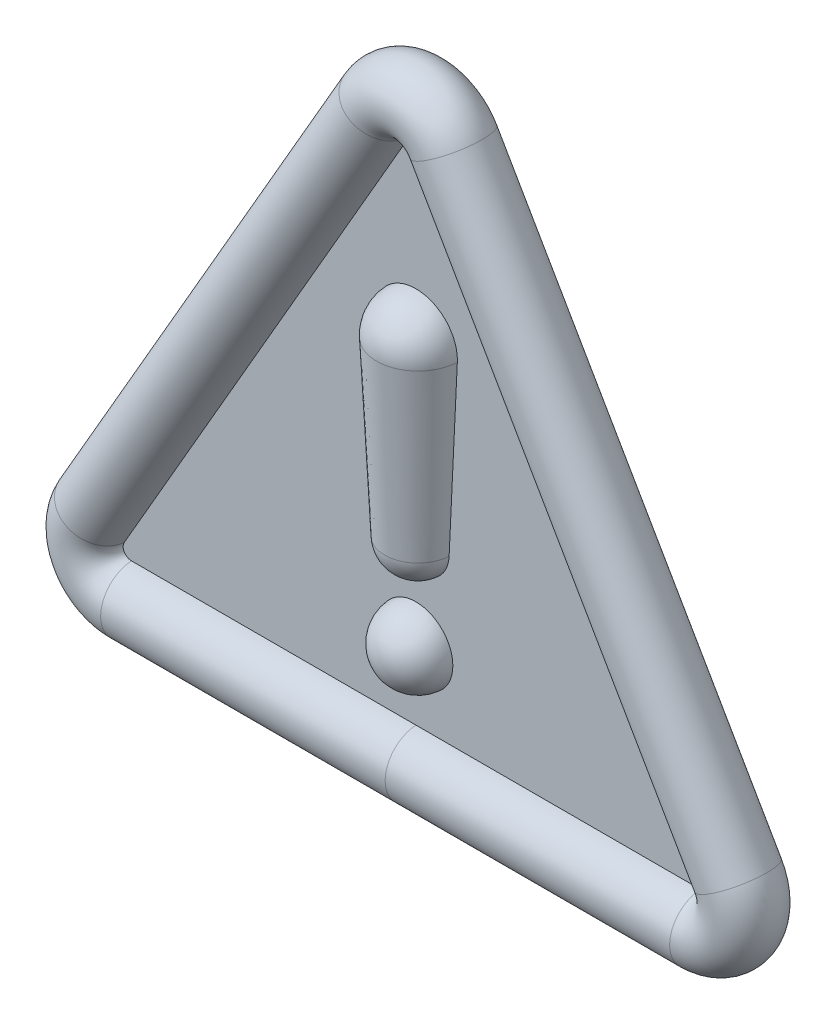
ISO-10303-21;
HEADER;
FILE_DESCRIPTION(('STEP AP214'),'2;1');
FILE_NAME('part.step','',(''),(''),'','','');
FILE_SCHEMA(('AUTOMOTIVE_DESIGN { 1 0 10303 214 1 1 1 1 }'));
ENDSEC;
DATA;
#1=APPLICATION_CONTEXT('core data for automotive mechanical design processes');
#2=APPLICATION_PROTOCOL_DEFINITION('international standard','automotive_design',2000,#1);
#3=PRODUCT_CONTEXT('',#1,'mechanical');
#4=PRODUCT('Part','Part','',(#3));
#5=PRODUCT_RELATED_PRODUCT_CATEGORY('part','',(#4));
#6=PRODUCT_DEFINITION_FORMATION('','',#4);
#7=PRODUCT_DEFINITION_CONTEXT('part definition',#1,'design');
#8=PRODUCT_DEFINITION('design','',#6,#7);
#9=PRODUCT_DEFINITION_SHAPE('','',#8);
#10=(LENGTH_UNIT() NAMED_UNIT(*) SI_UNIT(.MILLI.,.METRE.));
#11=(NAMED_UNIT(*) PLANE_ANGLE_UNIT() SI_UNIT($,.RADIAN.));
#12=(NAMED_UNIT(*) SI_UNIT($,.STERADIAN.) SOLID_ANGLE_UNIT());
#13=UNCERTAINTY_MEASURE_WITH_UNIT(LENGTH_MEASURE(1.E-05),#10,'distance_accuracy_value','');
#14=(GEOMETRIC_REPRESENTATION_CONTEXT(3) GLOBAL_UNCERTAINTY_ASSIGNED_CONTEXT((#13)) GLOBAL_UNIT_ASSIGNED_CONTEXT((#10,
#11,#12)) REPRESENTATION_CONTEXT('',''));
#15=CARTESIAN_POINT('',(0.,0.,0.));
#16=DIRECTION('',(0.,0.,1.));
#17=DIRECTION('',(1.,0.,0.));
#18=AXIS2_PLACEMENT_3D('',#15,#16,#17);
#19=CARTESIAN_POINT('',(-69.2820323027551,-50.,0.));
#20=DIRECTION('',(1.,0.,0.));
#21=DIRECTION('',(0.,1.,0.));
#22=AXIS2_PLACEMENT_3D('',#19,#20,#21);
#23=CYLINDRICAL_SURFACE('',#22,8.);
#24=CARTESIAN_POINT('',(-69.2820323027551,-50.,0.));
#25=DIRECTION('',(1.,0.,0.));
#26=DIRECTION('',(0.,0.,-1.));
#27=AXIS2_PLACEMENT_3D('',#24,#25,#26);
#28=CIRCLE('',#27,8.);
#29=CARTESIAN_POINT('',(-69.2820323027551,-42.0156402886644,0.5));
#30=VERTEX_POINT('',#29);
#31=CARTESIAN_POINT('',(-69.2820323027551,-42.0156402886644,-0.5));
#32=VERTEX_POINT('',#31);
#33=EDGE_CURVE('E264',#30,#32,#28,.T.);
#34=ORIENTED_EDGE('',*,*,#33,.T.);
#35=DIRECTION('',(1.,0.,0.));
#36=VECTOR('',#35,1.);
#37=CARTESIAN_POINT('',(-69.2820323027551,-42.0156402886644,-0.5));
#38=LINE('',#37,#36);
#39=CARTESIAN_POINT('',(0.,-42.0156402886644,-0.5));
#40=VERTEX_POINT('',#39);
#41=EDGE_CURVE('E243',#32,#40,#38,.T.);
#42=ORIENTED_EDGE('',*,*,#41,.T.);
#43=CARTESIAN_POINT('',(0.,-50.,0.));
#44=DIRECTION('',(1.,0.,0.));
#45=DIRECTION('',(0.,0.,-1.));
#46=AXIS2_PLACEMENT_3D('',#43,#44,#45);
#47=CIRCLE('',#46,8.);
#48=CARTESIAN_POINT('',(0.,-42.0156402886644,0.5));
#49=VERTEX_POINT('',#48);
#50=EDGE_CURVE('E246',#49,#40,#47,.T.);
#51=ORIENTED_EDGE('',*,*,#50,.F.);
#52=DIRECTION('',(1.,0.,0.));
#53=VECTOR('',#52,1.);
#54=CARTESIAN_POINT('',(-69.2820323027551,-42.0156402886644,0.5));
#55=LINE('',#54,#53);
#56=EDGE_CURVE('E225',#30,#49,#55,.T.);
#57=ORIENTED_EDGE('',*,*,#56,.F.);
#58=EDGE_LOOP('',(#34,#42,#51,#57));
#59=FACE_BOUND('',#58,.T.);
#60=ADVANCED_FACE('F36',(#59),#23,.T.);
#61=CARTESIAN_POINT('',(-69.2820323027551,-40.,0.));
#62=DIRECTION('',(0.,0.,1.));
#63=DIRECTION('',(1.,0.,0.));
#64=AXIS2_PLACEMENT_3D('',#61,#62,#63);
#65=TOROIDAL_SURFACE('',#64,10.,8.);
#66=CARTESIAN_POINT('',(-77.9422863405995,-35.,0.));
#67=DIRECTION('',(-0.5,-0.866025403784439,0.));
#68=DIRECTION('',(0.,0.,-1.));
#69=AXIS2_PLACEMENT_3D('',#66,#67,#68);
#70=CIRCLE('',#69,8.);
#71=CARTESIAN_POINT('',(-71.0276279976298,-38.9921798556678,0.5));
#72=VERTEX_POINT('',#71);
#73=CARTESIAN_POINT('',(-71.0276279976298,-38.9921798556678,-0.5));
#74=VERTEX_POINT('',#73);
#75=EDGE_CURVE('E261',#72,#74,#70,.T.);
#76=ORIENTED_EDGE('',*,*,#75,.T.);
#77=CARTESIAN_POINT('',(-69.2820323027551,-40.,-0.5));
#78=DIRECTION('',(0.,0.,-1.));
#79=DIRECTION('',(-1.,0.,0.));
#80=AXIS2_PLACEMENT_3D('',#77,#78,#79);
#81=CIRCLE('',#80,2.01564028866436);
#82=EDGE_CURVE('E240',#74,#32,#81,.F.);
#83=ORIENTED_EDGE('',*,*,#82,.T.);
#84=ORIENTED_EDGE('',*,*,#33,.F.);
#85=CARTESIAN_POINT('',(-69.2820323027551,-40.,0.5));
#86=DIRECTION('',(0.,0.,-1.));
#87=DIRECTION('',(-1.,0.,0.));
#88=AXIS2_PLACEMENT_3D('',#85,#86,#87);
#89=CIRCLE('',#88,2.01564028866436);
#90=EDGE_CURVE('E222',#72,#30,#89,.F.);
#91=ORIENTED_EDGE('',*,*,#90,.F.);
#92=EDGE_LOOP('',(#76,#83,#84,#91));
#93=FACE_BOUND('',#92,.T.);
#94=ADVANCED_FACE('F287',(#93),#65,.T.);
#95=CARTESIAN_POINT('',(-8.66025403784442,85.,0.));
#96=DIRECTION('',(-0.5,-0.866025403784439,0.));
#97=DIRECTION('',(0.866025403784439,-0.5,0.));
#98=AXIS2_PLACEMENT_3D('',#95,#96,#97);
#99=CYLINDRICAL_SURFACE('',#98,8.);
#100=CARTESIAN_POINT('',(-8.66025403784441,85.,0.));
#101=DIRECTION('',(-0.500000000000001,-0.866025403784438,0.));
#102=DIRECTION('',(0.,0.,-1.));
#103=AXIS2_PLACEMENT_3D('',#100,#101,#102);
#104=CIRCLE('',#103,8.);
#105=CARTESIAN_POINT('',(-1.74559569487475,81.0078201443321,0.5));
#106=VERTEX_POINT('',#105);
#107=CARTESIAN_POINT('',(-1.74559569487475,81.0078201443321,-0.5));
#108=VERTEX_POINT('',#107);
#109=EDGE_CURVE('E258',#106,#108,#104,.T.);
#110=ORIENTED_EDGE('',*,*,#109,.T.);
#111=DIRECTION('',(-0.5,-0.866025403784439,0.));
#112=VECTOR('',#111,1.);
#113=CARTESIAN_POINT('',(-1.74559569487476,81.0078201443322,-0.5));
#114=LINE('',#113,#112);
#115=EDGE_CURVE('E237',#108,#74,#114,.T.);
#116=ORIENTED_EDGE('',*,*,#115,.T.);
#117=ORIENTED_EDGE('',*,*,#75,.F.);
#118=DIRECTION('',(-0.5,-0.866025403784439,0.));
#119=VECTOR('',#118,1.);
#120=CARTESIAN_POINT('',(-1.74559569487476,81.0078201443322,0.5));
#121=LINE('',#120,#119);
#122=EDGE_CURVE('E219',#106,#72,#121,.T.);
#123=ORIENTED_EDGE('',*,*,#122,.F.);
#124=EDGE_LOOP('',(#110,#116,#117,#123));
#125=FACE_BOUND('',#124,.T.);
#126=ADVANCED_FACE('F283',(#125),#99,.T.);
#127=CARTESIAN_POINT('',(0.,80.,0.));
#128=DIRECTION('',(0.,0.,1.));
#129=DIRECTION('',(1.,0.,0.));
#130=AXIS2_PLACEMENT_3D('',#127,#128,#129);
#131=TOROIDAL_SURFACE('',#130,10.,8.);
#132=CARTESIAN_POINT('',(8.66025403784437,85.,0.));
#133=DIRECTION('',(-0.500000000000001,0.866025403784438,0.));
#134=DIRECTION('',(0.,0.,-1.));
#135=AXIS2_PLACEMENT_3D('',#132,#133,#134);
#136=CIRCLE('',#135,8.);
#137=CARTESIAN_POINT('',(1.74559569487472,81.0078201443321,0.5));
#138=VERTEX_POINT('',#137);
#139=CARTESIAN_POINT('',(1.74559569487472,81.0078201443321,-0.5));
#140=VERTEX_POINT('',#139);
#141=EDGE_CURVE('E255',#138,#140,#136,.T.);
#142=ORIENTED_EDGE('',*,*,#141,.T.);
#143=CARTESIAN_POINT('',(0.,80.,-0.5));
#144=DIRECTION('',(0.,0.,-1.));
#145=DIRECTION('',(-1.,0.,0.));
#146=AXIS2_PLACEMENT_3D('',#143,#144,#145);
#147=CIRCLE('',#146,2.01564028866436);
#148=EDGE_CURVE('E234',#140,#108,#147,.F.);
#149=ORIENTED_EDGE('',*,*,#148,.T.);
#150=ORIENTED_EDGE('',*,*,#109,.F.);
#151=CARTESIAN_POINT('',(0.,80.,0.5));
#152=DIRECTION('',(0.,0.,-1.));
#153=DIRECTION('',(-1.,0.,0.));
#154=AXIS2_PLACEMENT_3D('',#151,#152,#153);
#155=CIRCLE('',#154,2.01564028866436);
#156=EDGE_CURVE('E216',#138,#106,#155,.F.);
#157=ORIENTED_EDGE('',*,*,#156,.F.);
#158=EDGE_LOOP('',(#142,#149,#150,#157));
#159=FACE_BOUND('',#158,.T.);
#160=ADVANCED_FACE('F280',(#159),#131,.T.);
#161=CARTESIAN_POINT('',(77.9422863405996,-35.,0.));
#162=DIRECTION('',(-0.500000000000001,0.866025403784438,0.));
#163=DIRECTION('',(-0.866025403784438,-0.500000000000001,0.));
#164=AXIS2_PLACEMENT_3D('',#161,#162,#163);
#165=CYLINDRICAL_SURFACE('',#164,8.);
#166=CARTESIAN_POINT('',(77.9422863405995,-35.,0.));
#167=DIRECTION('',(-0.5,0.866025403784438,0.));
#168=DIRECTION('',(0.,0.,-1.));
#169=AXIS2_PLACEMENT_3D('',#166,#167,#168);
#170=CIRCLE('',#169,8.);
#171=CARTESIAN_POINT('',(71.0276279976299,-38.9921798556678,0.5));
#172=VERTEX_POINT('',#171);
#173=CARTESIAN_POINT('',(71.0276279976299,-38.9921798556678,-0.5));
#174=VERTEX_POINT('',#173);
#175=EDGE_CURVE('E252',#172,#174,#170,.T.);
#176=ORIENTED_EDGE('',*,*,#175,.T.);
#177=DIRECTION('',(-0.500000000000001,0.866025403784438,0.));
#178=VECTOR('',#177,1.);
#179=CARTESIAN_POINT('',(71.0276279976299,-38.9921798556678,-0.5));
#180=LINE('',#179,#178);
#181=EDGE_CURVE('E231',#174,#140,#180,.T.);
#182=ORIENTED_EDGE('',*,*,#181,.T.);
#183=ORIENTED_EDGE('',*,*,#141,.F.);
#184=DIRECTION('',(-0.500000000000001,0.866025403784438,0.));
#185=VECTOR('',#184,1.);
#186=CARTESIAN_POINT('',(71.0276279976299,-38.9921798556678,0.5));
#187=LINE('',#186,#185);
#188=EDGE_CURVE('E213',#172,#138,#187,.T.);
#189=ORIENTED_EDGE('',*,*,#188,.F.);
#190=EDGE_LOOP('',(#176,#182,#183,#189));
#191=FACE_BOUND('',#190,.T.);
#192=ADVANCED_FACE('F278',(#191),#165,.T.);
#193=CARTESIAN_POINT('',(69.2820323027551,-40.,0.));
#194=DIRECTION('',(0.,0.,1.));
#195=DIRECTION('',(1.,0.,0.));
#196=AXIS2_PLACEMENT_3D('',#193,#194,#195);
#197=TOROIDAL_SURFACE('',#196,10.,8.);
#198=CARTESIAN_POINT('',(69.2820323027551,-50.,0.));
#199=DIRECTION('',(1.,0.,0.));
#200=DIRECTION('',(0.,0.,-1.));
#201=AXIS2_PLACEMENT_3D('',#198,#199,#200);
#202=CIRCLE('',#201,8.);
#203=CARTESIAN_POINT('',(69.2820323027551,-42.0156402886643,0.5));
#204=VERTEX_POINT('',#203);
#205=CARTESIAN_POINT('',(69.2820323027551,-42.0156402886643,-0.500000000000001));
#206=VERTEX_POINT('',#205);
#207=EDGE_CURVE('E249',#204,#206,#202,.T.);
#208=ORIENTED_EDGE('',*,*,#207,.T.);
#209=CARTESIAN_POINT('',(69.2820323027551,-40.,-0.5));
#210=DIRECTION('',(0.,0.,-1.));
#211=DIRECTION('',(-1.,0.,0.));
#212=AXIS2_PLACEMENT_3D('',#209,#210,#211);
#213=CIRCLE('',#212,2.01564028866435);
#214=EDGE_CURVE('E228',#206,#174,#213,.F.);
#215=ORIENTED_EDGE('',*,*,#214,.T.);
#216=ORIENTED_EDGE('',*,*,#175,.F.);
#217=CARTESIAN_POINT('',(69.2820323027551,-40.,0.5));
#218=DIRECTION('',(0.,0.,-1.));
#219=DIRECTION('',(-1.,0.,0.));
#220=AXIS2_PLACEMENT_3D('',#217,#218,#219);
#221=CIRCLE('',#220,2.01564028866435);
#222=EDGE_CURVE('E206',#204,#172,#221,.F.);
#223=ORIENTED_EDGE('',*,*,#222,.F.);
#224=EDGE_LOOP('',(#208,#215,#216,#223));
#225=FACE_BOUND('',#224,.T.);
#226=ADVANCED_FACE('F274',(#225),#197,.T.);
#227=CARTESIAN_POINT('',(0.,-50.,0.));
#228=DIRECTION('',(1.,0.,0.));
#229=DIRECTION('',(0.,1.,0.));
#230=AXIS2_PLACEMENT_3D('',#227,#228,#229);
#231=CYLINDRICAL_SURFACE('',#230,8.);
#232=ORIENTED_EDGE('',*,*,#50,.T.);
#233=DIRECTION('',(1.,0.,0.));
#234=VECTOR('',#233,1.);
#235=CARTESIAN_POINT('',(0.,-42.0156402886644,-0.5));
#236=LINE('',#235,#234);
#237=EDGE_CURVE('E168',#40,#206,#236,.T.);
#238=ORIENTED_EDGE('',*,*,#237,.T.);
#239=ORIENTED_EDGE('',*,*,#207,.F.);
#240=DIRECTION('',(1.,0.,0.));
#241=VECTOR('',#240,1.);
#242=CARTESIAN_POINT('',(0.,-42.0156402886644,0.5));
#243=LINE('',#242,#241);
#244=EDGE_CURVE('E266',#49,#204,#243,.T.);
#245=ORIENTED_EDGE('',*,*,#244,.F.);
#246=EDGE_LOOP('',(#232,#238,#239,#245));
#247=FACE_BOUND('',#246,.T.);
#248=ADVANCED_FACE('F180',(#247),#231,.T.);
#249=CARTESIAN_POINT('',(0.,0.,0.5));
#250=DIRECTION('',(0.,0.,1.));
#251=DIRECTION('',(1.,0.,0.));
#252=AXIS2_PLACEMENT_3D('',#249,#250,#251);
#253=PLANE('',#252);
#254=CARTESIAN_POINT('',(0.,-25.,0.5));
#255=DIRECTION('',(0.,0.,1.));
#256=DIRECTION('',(1.,0.,0.));
#257=AXIS2_PLACEMENT_3D('',#254,#255,#256);
#258=CIRCLE('',#257,8.98610037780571);
#259=CARTESIAN_POINT('',(8.98610037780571,-25.,0.5));
#260=VERTEX_POINT('',#259);
#261=EDGE_CURVE('E11',#260,#260,#258,.T.);
#262=ORIENTED_EDGE('',*,*,#261,.F.);
#263=EDGE_LOOP('',(#262));
#264=FACE_BOUND('',#263,.T.);
#265=CARTESIAN_POINT('',(0.,49.9919967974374,0.5));
#266=CARTESIAN_POINT('',(-0.0833880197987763,49.9919946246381,0.5));
#267=CARTESIAN_POINT('',(-0.166772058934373,49.9911721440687,0.5));
#268=CARTESIAN_POINT('',(-0.333516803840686,49.9877411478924,0.5));
#269=CARTESIAN_POINT('',(-0.416877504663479,49.9851323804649,0.5));
#270=CARTESIAN_POINT('',(-0.667746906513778,49.9743327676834,0.5));
#271=CARTESIAN_POINT('',(-0.835139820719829,49.9631649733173,0.5));
#272=CARTESIAN_POINT('',(-1.16918140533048,49.9325297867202,0.5));
#273=CARTESIAN_POINT('',(-1.33582998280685,49.9130613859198,0.5));
#274=CARTESIAN_POINT('',(-1.66813611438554,49.8657809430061,0.5));
#275=CARTESIAN_POINT('',(-1.83379233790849,49.8379595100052,0.5));
#276=CARTESIAN_POINT('',(-2.16350967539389,49.7740208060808,0.5));
#277=CARTESIAN_POINT('',(-2.32757055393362,49.7379023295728,0.5));
#278=CARTESIAN_POINT('',(-2.76322335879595,49.6304151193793,0.5));
#279=CARTESIAN_POINT('',(-3.03303219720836,49.5516636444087,0.5));
#280=CARTESIAN_POINT('',(-3.5651125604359,49.3717050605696,0.5));
#281=CARTESIAN_POINT('',(-3.82738178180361,49.2704911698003,0.5));
#282=CARTESIAN_POINT('',(-4.34270044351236,49.0462273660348,0.5));
#283=CARTESIAN_POINT('',(-4.59574142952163,48.9231580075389,0.5));
#284=CARTESIAN_POINT('',(-5.09054889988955,48.6561164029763,0.5));
#285=CARTESIAN_POINT('',(-5.33231507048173,48.5121435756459,0.5));
#286=CARTESIAN_POINT('',(-5.80270347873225,48.2044139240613,0.5));
#287=CARTESIAN_POINT('',(-6.03133351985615,48.0406690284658,0.5));
#288=CARTESIAN_POINT('',(-6.4739821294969,47.6944882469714,0.5));
#289=CARTESIAN_POINT('',(-6.68800044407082,47.5120520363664,0.5));
#290=CARTESIAN_POINT('',(-7.09984445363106,47.1298384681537,0.5));
#291=CARTESIAN_POINT('',(-7.29767431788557,46.9300656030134,0.5));
#292=CARTESIAN_POINT('',(-7.67579125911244,46.5145636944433,0.5));
#293=CARTESIAN_POINT('',(-7.85607871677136,46.2988349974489,0.5));
#294=CARTESIAN_POINT('',(-8.19777856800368,45.853023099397,0.5));
#295=CARTESIAN_POINT('',(-8.35919694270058,45.6229444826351,0.5));
#296=CARTESIAN_POINT('',(-8.66207732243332,45.1500064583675,0.5));
#297=CARTESIAN_POINT('',(-8.80353931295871,44.907147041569,0.5));
#298=CARTESIAN_POINT('',(-9.06550792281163,44.4103608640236,0.5));
#299=CARTESIAN_POINT('',(-9.18601341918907,44.1564335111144,0.5));
#300=CARTESIAN_POINT('',(-9.40520281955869,43.6393291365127,0.5));
#301=CARTESIAN_POINT('',(-9.50388672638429,43.3761521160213,0.5));
#302=CARTESIAN_POINT('',(-9.67872509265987,42.8424383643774,0.5));
#303=CARTESIAN_POINT('',(-9.75488112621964,42.5719021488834,0.5));
#304=CARTESIAN_POINT('',(-9.88413152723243,42.0253757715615,0.5));
#305=CARTESIAN_POINT('',(-9.93722589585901,41.749385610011,0.5));
#306=CARTESIAN_POINT('',(-10.0199750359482,41.1939163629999,0.5));
#307=CARTESIAN_POINT('',(-10.0496300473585,40.9144373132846,0.5));
#308=CARTESIAN_POINT('',(-10.0852905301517,40.3539744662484,0.5));
#309=CARTESIAN_POINT('',(-10.0912960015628,40.0729906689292,0.5));
#310=CARTESIAN_POINT('',(-10.0796147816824,39.5115196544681,0.5));
#311=CARTESIAN_POINT('',(-10.0619283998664,39.2310324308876,0.5));
#312=CARTESIAN_POINT('',(-10.002989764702,38.672544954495,0.5));
#313=CARTESIAN_POINT('',(-9.96173751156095,38.3945447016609,0.5));
#314=CARTESIAN_POINT('',(-9.85595967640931,37.8430036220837,0.5));
#315=CARTESIAN_POINT('',(-9.79143376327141,37.5694628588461,0.5));
#316=CARTESIAN_POINT('',(-9.6395674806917,37.0287895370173,0.5));
#317=CARTESIAN_POINT('',(-9.55222711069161,36.7616569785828,0.5));
#318=CARTESIAN_POINT('',(-9.35534953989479,36.235690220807,0.5));
#319=CARTESIAN_POINT('',(-9.24581158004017,35.9768563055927,0.5));
#320=CARTESIAN_POINT('',(-9.00531953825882,35.4693366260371,0.5));
#321=CARTESIAN_POINT('',(-8.87436545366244,35.2206508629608,0.5));
#322=CARTESIAN_POINT('',(-8.59198394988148,34.7352155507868,0.5));
#323=CARTESIAN_POINT('',(-8.44055821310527,34.4984650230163,0.5));
#324=CARTESIAN_POINT('',(-8.11830184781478,34.0385613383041,0.5));
#325=CARTESIAN_POINT('',(-7.94747123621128,33.815408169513,0.5));
#326=CARTESIAN_POINT('',(-7.58764744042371,33.3843185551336,0.5));
#327=CARTESIAN_POINT('',(-7.39865707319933,33.176379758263,0.5));
#328=CARTESIAN_POINT('',(-7.00383048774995,32.7771538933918,0.5));
#329=CARTESIAN_POINT('',(-6.79799390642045,32.585867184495,0.5));
#330=CARTESIAN_POINT('',(-6.37085814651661,32.2212383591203,0.5));
#331=CARTESIAN_POINT('',(-6.14955297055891,32.0479032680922,0.5));
#332=CARTESIAN_POINT('',(-5.6931283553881,31.7204970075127,0.5));
#333=CARTESIAN_POINT('',(-5.45800908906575,31.5664255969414,0.5));
#334=CARTESIAN_POINT('',(-4.97546178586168,31.2785401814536,0.5));
#335=CARTESIAN_POINT('',(-4.72802543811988,31.1447401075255,0.5));
#336=CARTESIAN_POINT('',(-4.22275948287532,30.8984773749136,0.5));
#337=CARTESIAN_POINT('',(-3.96493016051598,30.7860141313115,0.5));
#338=CARTESIAN_POINT('',(-3.44111335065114,30.5833707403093,0.5));
#339=CARTESIAN_POINT('',(-3.17513872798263,30.493157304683,0.5));
#340=CARTESIAN_POINT('',(-2.63657779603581,30.3354369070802,0.5));
#341=CARTESIAN_POINT('',(-2.3639930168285,30.2679247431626,0.5));
#342=CARTESIAN_POINT('',(-1.91730290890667,30.1770212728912,0.5));
#343=CARTESIAN_POINT('',(-1.74459908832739,30.146578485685,0.5));
#344=CARTESIAN_POINT('',(-1.39788132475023,30.0947798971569,0.5));
#345=CARTESIAN_POINT('',(-1.223867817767,30.0734211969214,0.5));
#346=CARTESIAN_POINT('',(-0.874847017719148,30.0397663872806,0.5));
#347=CARTESIAN_POINT('',(-0.699839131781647,30.0274764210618,0.5));
#348=CARTESIAN_POINT('',(-0.437018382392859,30.0155618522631,0.5));
#349=CARTESIAN_POINT('',(-0.349339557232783,30.0126771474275,0.5));
#350=CARTESIAN_POINT('',(-0.173932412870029,30.0088934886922,0.5));
#351=CARTESIAN_POINT('',(-0.0862040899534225,30.0079947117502,0.5));
#352=CARTESIAN_POINT('',(0.148801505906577,30.0080177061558,0.5));
#353=CARTESIAN_POINT('',(0.296083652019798,30.0105891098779,0.5));
#354=CARTESIAN_POINT('',(0.590424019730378,30.0217206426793,0.5));
#355=CARTESIAN_POINT('',(0.737482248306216,30.03028058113,0.5));
#356=CARTESIAN_POINT('',(1.03107840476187,30.0537742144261,0.5));
#357=CARTESIAN_POINT('',(1.17761638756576,30.0687072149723,0.5));
#358=CARTESIAN_POINT('',(1.46989288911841,30.1049788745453,0.5));
#359=CARTESIAN_POINT('',(1.61563137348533,30.1263178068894,0.5));
#360=CARTESIAN_POINT('',(2.0512353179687,30.1999445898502,0.5));
#361=CARTESIAN_POINT('',(2.33953931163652,30.2618464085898,0.5));
#362=CARTESIAN_POINT('',(2.90957373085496,30.4108614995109,0.5));
#363=CARTESIAN_POINT('',(3.19130285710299,30.4979797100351,0.5));
#364=CARTESIAN_POINT('',(3.74100465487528,30.6949799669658,0.5));
#365=CARTESIAN_POINT('',(4.00913333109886,30.8044263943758,0.5));
#366=CARTESIAN_POINT('',(4.53485561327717,31.0461610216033,0.5));
#367=CARTESIAN_POINT('',(4.79245023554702,31.1784470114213,0.5));
#368=CARTESIAN_POINT('',(5.29530147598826,31.4649362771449,0.5));
#369=CARTESIAN_POINT('',(5.54055252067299,31.6191493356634,0.5));
#370=CARTESIAN_POINT('',(6.01673869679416,31.9482851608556,0.5));
#371=CARTESIAN_POINT('',(6.24767400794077,32.1232076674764,0.5));
#372=CARTESIAN_POINT('',(6.6869207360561,32.4870032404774,0.5));
#373=CARTESIAN_POINT('',(6.89569790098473,32.6753143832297,0.5));
#374=CARTESIAN_POINT('',(7.29663532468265,33.0688557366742,0.5));
#375=CARTESIAN_POINT('',(7.48879614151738,33.2740853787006,0.5));
#376=CARTESIAN_POINT('',(7.85508219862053,33.699941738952,0.5));
#377=CARTESIAN_POINT('',(8.02921300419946,33.9205636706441,0.5));
#378=CARTESIAN_POINT('',(8.35827081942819,34.3756950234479,0.5));
#379=CARTESIAN_POINT('',(8.5131976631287,34.6102045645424,0.5));
#380=CARTESIAN_POINT('',(8.80273249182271,35.091422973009,0.5));
#381=CARTESIAN_POINT('',(8.93734207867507,35.3381308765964,0.5));
#382=CARTESIAN_POINT('',(9.18529976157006,35.8420087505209,0.5));
#383=CARTESIAN_POINT('',(9.29864790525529,36.0991786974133,0.5));
#384=CARTESIAN_POINT('',(9.50328772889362,36.6221799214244,0.5));
#385=CARTESIAN_POINT('',(9.59457713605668,36.8880120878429,0.5));
#386=CARTESIAN_POINT('',(9.75443526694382,37.4264225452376,0.5));
#387=CARTESIAN_POINT('',(9.82300397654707,37.6990008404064,0.5));
#388=CARTESIAN_POINT('',(9.93692929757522,38.2489471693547,0.5));
#389=CARTESIAN_POINT('',(9.9822874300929,38.5263148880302,0.5));
#390=CARTESIAN_POINT('',(10.0494758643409,39.0838854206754,0.5));
#391=CARTESIAN_POINT('',(10.0713061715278,39.3640882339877,0.5));
#392=CARTESIAN_POINT('',(10.0912834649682,39.925328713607,0.5));
#393=CARTESIAN_POINT('',(10.0894311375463,40.2063663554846,0.5));
#394=CARTESIAN_POINT('',(10.0620579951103,40.7672866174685,0.5));
#395=CARTESIAN_POINT('',(10.0365371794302,41.0471692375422,0.5));
#396=CARTESIAN_POINT('',(9.96200857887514,41.6037891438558,0.5));
#397=CARTESIAN_POINT('',(9.91300083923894,41.8805264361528,0.5));
#398=CARTESIAN_POINT('',(9.79184684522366,42.4288888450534,0.5));
#399=CARTESIAN_POINT('',(9.7197005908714,42.7005139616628,0.5));
#400=CARTESIAN_POINT('',(9.55278084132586,43.2367263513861,0.5));
#401=CARTESIAN_POINT('',(9.45800689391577,43.5013134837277,0.5));
#402=CARTESIAN_POINT('',(9.2465063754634,44.0215632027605,0.5));
#403=CARTESIAN_POINT('',(9.12977980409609,44.2772257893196,0.5));
#404=CARTESIAN_POINT('',(8.8751988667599,44.7778188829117,0.5));
#405=CARTESIAN_POINT('',(8.73734365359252,45.0227489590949,0.5));
#406=CARTESIAN_POINT('',(8.44148905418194,45.5001248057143,0.5));
#407=CARTESIAN_POINT('',(8.28348966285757,45.7325705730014,0.5));
#408=CARTESIAN_POINT('',(7.94848589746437,46.1833041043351,0.5));
#409=CARTESIAN_POINT('',(7.77148329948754,46.4015931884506,0.5));
#410=CARTESIAN_POINT('',(7.39971969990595,46.8224852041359,0.5));
#411=CARTESIAN_POINT('',(7.20495872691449,47.0250881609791,0.5));
#412=CARTESIAN_POINT('',(6.79909976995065,47.4131330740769,0.5));
#413=CARTESIAN_POINT('',(6.58800476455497,47.5985781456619,0.5));
#414=CARTESIAN_POINT('',(6.15094231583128,47.9510354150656,0.5));
#415=CARTESIAN_POINT('',(5.92497455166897,48.1180472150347,0.5));
#416=CARTESIAN_POINT('',(5.45966565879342,48.4325224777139,0.5));
#417=CARTESIAN_POINT('',(5.22031820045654,48.579976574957,0.5));
#418=CARTESIAN_POINT('',(4.73005790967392,48.8541914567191,0.5));
#419=CARTESIAN_POINT('',(4.47914539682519,48.9809528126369,0.5));
#420=CARTESIAN_POINT('',(3.96730683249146,49.2129918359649,0.5));
#421=CARTESIAN_POINT('',(3.70637206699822,49.3182502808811,0.5));
#422=CARTESIAN_POINT('',(3.17656385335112,49.5063950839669,0.5));
#423=CARTESIAN_POINT('',(2.90769061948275,49.5892820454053,0.5));
#424=CARTESIAN_POINT('',(2.3644215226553,49.7319828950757,0.5));
#425=CARTESIAN_POINT('',(2.09003659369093,49.7918384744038,0.5));
#426=CARTESIAN_POINT('',(1.53732304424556,49.8882868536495,0.5));
#427=CARTESIAN_POINT('',(1.25899648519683,49.9248913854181,0.5));
#428=CARTESIAN_POINT('',(0.81679901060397,49.9644594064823,0.5));
#429=CARTESIAN_POINT('',(0.653571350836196,49.9750853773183,0.5));
#430=CARTESIAN_POINT('',(0.326890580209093,49.9888541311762,0.5));
#431=CARTESIAN_POINT('',(0.163437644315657,49.9920010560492,0.5));
#432=CARTESIAN_POINT('',(0.,49.9919967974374,0.5));
#433=B_SPLINE_CURVE_WITH_KNOTS('',3,(#265,#266,#267,#268,#269,#270,#271,#272,#273,#274,#275,
#276,#277,#278,#279,#280,#281,#282,#283,#284,#285,#286,#287,#288,#289,#290,#291,#292,#293,#294,
#295,#296,#297,#298,#299,#300,#301,#302,#303,#304,#305,#306,#307,#308,#309,#310,#311,#312,#313,
#314,#315,#316,#317,#318,#319,#320,#321,#322,#323,#324,#325,#326,#327,#328,#329,#330,#331,#332,
#333,#334,#335,#336,#337,#338,#339,#340,#341,#342,#343,#344,#345,#346,#347,#348,#349,#350,#351,
#352,#353,#354,#355,#356,#357,#358,#359,#360,#361,#362,#363,#364,#365,#366,#367,#368,#369,#370,
#371,#372,#373,#374,#375,#376,#377,#378,#379,#380,#381,#382,#383,#384,#385,#386,#387,#388,#389,
#390,#391,#392,#393,#394,#395,#396,#397,#398,#399,#400,#401,#402,#403,#404,#405,#406,#407,#408,
#409,#410,#411,#412,#413,#414,#415,#416,#417,#418,#419,#420,#421,#422,#423,#424,#425,#426,#427,
#428,#429,#430,#431,#432),.UNSPECIFIED.,.T.,.F.,(4,2,2,2,2,2,2,2,2,2,2,2,2,2,2,2,2,2,2,2,2,2,2,
2,2,2,2,2,2,2,2,2,2,2,2,2,2,2,2,2,2,2,2,2,2,2,2,2,2,2,2,2,2,2,2,2,2,2,2,2,2,2,2,2,2,2,2,2,2,2,2,
2,2,2,2,2,2,2,2,2,2,2,2,4),(0.,0.250151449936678,0.500338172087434,1.00341828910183,
1.50655955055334,2.01026859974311,2.51405088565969,3.35618159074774,4.19856690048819,
5.04170549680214,5.88486754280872,6.72752341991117,7.57019393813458,8.41264674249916,
9.25508126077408,10.097248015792,10.9394153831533,11.7816278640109,12.6238402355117,
13.4659937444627,14.3081472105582,15.1502920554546,15.9924368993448,16.8345707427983,
17.676704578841,18.5188503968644,19.3609962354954,20.2031708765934,21.0453456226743,
21.8874511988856,22.7295560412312,23.571530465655,24.4135230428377,25.2558439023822,
26.0981542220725,26.9410407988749,27.783904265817,28.6254989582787,29.4669006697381,
29.9927841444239,30.5184996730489,31.0445709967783,31.3077290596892,31.5709105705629,
32.012715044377,32.4545054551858,32.8962477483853,33.3380088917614,34.2213810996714,
35.1049264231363,35.9726483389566,36.8402863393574,37.7083126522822,38.5763280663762,
39.4188030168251,40.2612496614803,41.1034354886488,41.945628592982,42.7877552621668,
43.6298800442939,44.4720915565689,45.3143035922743,46.1564604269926,46.9986170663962,
47.840749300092,48.6828815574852,49.5250121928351,50.3671428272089,51.2092902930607,
52.0514377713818,52.8936190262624,53.7358004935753,54.577903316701,55.4200047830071,
56.2619530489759,57.1039194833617,57.9462876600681,58.7886325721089,59.6317272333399,
60.4747991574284,61.3163377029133,62.1574512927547,62.6480112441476,63.1382994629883),.UNSPECIFIED.);
#434=CARTESIAN_POINT('',(10.0762579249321,39.5238095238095,0.5));
#435=VERTEX_POINT('',#434);
#436=CARTESIAN_POINT('',(-10.0762579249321,39.5238095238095,0.5));
#437=VERTEX_POINT('',#436);
#438=EDGE_CURVE('E56',#435,#437,#433,.T.);
#439=ORIENTED_EDGE('',*,*,#438,.F.);
#440=CARTESIAN_POINT('',(5.85234179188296,-48.8906456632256,0.5));
#441=CARTESIAN_POINT('',(6.03097563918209,-45.1571318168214,0.5));
#442=CARTESIAN_POINT('',(6.2095552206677,-41.4236153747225,0.5));
#443=CARTESIAN_POINT('',(6.74515763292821,-30.2230595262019,0.5));
#444=CARTESIAN_POINT('',(7.1020441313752,-22.7560136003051,0.5));
#445=CARTESIAN_POINT('',(7.81559472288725,-7.82191111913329,0.5));
#446=CARTESIAN_POINT('',(8.17225881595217,-0.354854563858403,0.5));
#447=CARTESIAN_POINT('',(9.15699876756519,20.2657392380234,0.5));
#448=CARTESIAN_POINT('',(9.78492031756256,33.4192838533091,0.5));
#449=CARTESIAN_POINT('',(11.0404939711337,59.7263859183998,0.5));
#450=CARTESIAN_POINT('',(11.668146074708,72.8799433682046,0.5));
#451=CARTESIAN_POINT('',(12.2957564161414,86.0335028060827,0.5));
#452=B_SPLINE_CURVE_WITH_KNOTS('',3,(#440,#441,#442,#443,#444,#445,#446,#447,#448,#449,#450,
#451),.UNSPECIFIED.,.F.,.F.,(4,2,2,2,2,4),(0.,11.2133545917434,33.6400637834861,56.06677298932,
95.5723446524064,135.077916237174),.UNSPECIFIED.);
#453=CARTESIAN_POINT('',(8.07546037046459,-2.38095238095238,0.5));
#454=VERTEX_POINT('',#453);
#455=EDGE_CURVE('E115',#454,#435,#452,.T.);
#456=ORIENTED_EDGE('',*,*,#455,.F.);
#457=CARTESIAN_POINT('',(0.,-9.98999374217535,0.5));
#458=CARTESIAN_POINT('',(0.0834219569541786,-9.98999268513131,0.5));
#459=CARTESIAN_POINT('',(0.166835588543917,-9.98896210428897,0.5));
#460=CARTESIAN_POINT('',(0.333623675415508,-9.98466729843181,0.5));
#461=CARTESIAN_POINT('',(0.416998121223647,-9.98140268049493,0.5));
#462=CARTESIAN_POINT('',(0.668408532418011,-9.96785683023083,0.5));
#463=CARTESIAN_POINT('',(0.836261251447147,-9.9538160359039,0.5));
#464=CARTESIAN_POINT('',(1.17079726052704,-9.91529451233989,0.5));
#465=CARTESIAN_POINT('',(1.33748028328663,-9.89081147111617,0.5));
#466=CARTESIAN_POINT('',(1.66921105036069,-9.8313785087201,0.5));
#467=CARTESIAN_POINT('',(1.83425623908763,-9.79641428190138,0.5));
#468=CARTESIAN_POINT('',(2.16181614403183,-9.71613301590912,0.5));
#469=CARTESIAN_POINT('',(2.3243306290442,-9.67081503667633,0.5));
#470=CARTESIAN_POINT('',(2.6995274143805,-9.55327523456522,0.5));
#471=CARTESIAN_POINT('',(2.91098895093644,-9.47711446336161,0.5));
#472=CARTESIAN_POINT('',(3.32677320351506,-9.30724509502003,0.5));
#473=CARTESIAN_POINT('',(3.53109454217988,-9.21353313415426,0.5));
#474=CARTESIAN_POINT('',(3.93121179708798,-9.00918069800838,0.5));
#475=CARTESIAN_POINT('',(4.12700375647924,-8.89853247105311,0.5));
#476=CARTESIAN_POINT('',(4.50856587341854,-8.66112268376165,0.5));
#477=CARTESIAN_POINT('',(4.6943358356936,-8.53436080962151,0.5));
#478=CARTESIAN_POINT('',(5.05447181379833,-8.26566786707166,0.5));
#479=CARTESIAN_POINT('',(5.22884133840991,-8.123741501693,0.5));
#480=CARTESIAN_POINT('',(5.56499907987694,-7.82569508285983,0.5));
#481=CARTESIAN_POINT('',(5.7267871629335,-7.66957487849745,0.5));
#482=CARTESIAN_POINT('',(6.03657572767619,-7.34430772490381,0.5));
#483=CARTESIAN_POINT('',(6.18458084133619,-7.17516518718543,0.5));
#484=CARTESIAN_POINT('',(6.46586067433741,-6.82494937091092,0.5));
#485=CARTESIAN_POINT('',(6.59913027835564,-6.64387198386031,0.5));
#486=CARTESIAN_POINT('',(6.84985563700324,-6.27124005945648,0.5));
#487=CARTESIAN_POINT('',(6.96732086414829,-6.07969189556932,0.5));
#488=CARTESIAN_POINT('',(7.18569837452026,-5.68737755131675,0.5));
#489=CARTESIAN_POINT('',(7.28661040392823,-5.48661122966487,0.5));
#490=CARTESIAN_POINT('',(7.47116335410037,-5.07728699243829,0.5));
#491=CARTESIAN_POINT('',(7.55480395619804,-4.86872893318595,0.5));
#492=CARTESIAN_POINT('',(7.70421854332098,-4.44530289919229,0.5));
#493=CARTESIAN_POINT('',(7.7699921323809,-4.23043478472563,0.5));
#494=CARTESIAN_POINT('',(7.88318708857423,-3.79597998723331,0.5));
#495=CARTESIAN_POINT('',(7.9306134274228,-3.57639459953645,0.5));
#496=CARTESIAN_POINT('',(8.00681546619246,-3.13393168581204,0.5));
#497=CARTESIAN_POINT('',(8.03558461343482,-2.91105303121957,0.5));
#498=CARTESIAN_POINT('',(8.07423321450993,-2.46375588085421,0.5));
#499=CARTESIAN_POINT('',(8.0841203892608,-2.23933805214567,0.5));
#500=CARTESIAN_POINT('',(8.08495833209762,-1.79036522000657,0.5));
#501=CARTESIAN_POINT('',(8.07590051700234,-1.56581020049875,0.5));
#502=CARTESIAN_POINT('',(8.03889583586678,-1.11826576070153,0.5));
#503=CARTESIAN_POINT('',(8.01094928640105,-0.895276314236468,0.5));
#504=CARTESIAN_POINT('',(7.93638320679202,-0.452545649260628,0.5));
#505=CARTESIAN_POINT('',(7.88977214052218,-0.232803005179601,0.5));
#506=CARTESIAN_POINT('',(7.77818538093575,0.202065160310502,0.5));
#507=CARTESIAN_POINT('',(7.71320215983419,0.417188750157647,0.5));
#508=CARTESIAN_POINT('',(7.56536716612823,0.841121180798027,0.5));
#509=CARTESIAN_POINT('',(7.48252167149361,1.04993221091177,0.5));
#510=CARTESIAN_POINT('',(7.29951727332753,1.45987997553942,0.5));
#511=CARTESIAN_POINT('',(7.19935453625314,1.66101499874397,0.5));
#512=CARTESIAN_POINT('',(6.98244297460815,2.05412747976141,0.5));
#513=CARTESIAN_POINT('',(6.86569451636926,2.24610513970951,0.5));
#514=CARTESIAN_POINT('',(6.61644660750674,2.6195330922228,0.5));
#515=CARTESIAN_POINT('',(6.48394798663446,2.80098393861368,0.5));
#516=CARTESIAN_POINT('',(6.20413914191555,3.15207681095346,0.5));
#517=CARTESIAN_POINT('',(6.05682914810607,3.32171902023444,0.5));
#518=CARTESIAN_POINT('',(5.74843684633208,3.64799895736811,0.5));
#519=CARTESIAN_POINT('',(5.58735396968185,3.80463614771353,0.5));
#520=CARTESIAN_POINT('',(5.25262457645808,4.10373350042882,0.5));
#521=CARTESIAN_POINT('',(5.07898242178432,4.24619854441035,0.5));
#522=CARTESIAN_POINT('',(4.72021309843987,4.51608190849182,0.5));
#523=CARTESIAN_POINT('',(4.53507920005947,4.64349128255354,0.5));
#524=CARTESIAN_POINT('',(4.15474049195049,4.88225828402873,0.5));
#525=CARTESIAN_POINT('',(3.9595359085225,4.9936162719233,0.5));
#526=CARTESIAN_POINT('',(3.56026628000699,5.1995854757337,0.5));
#527=CARTESIAN_POINT('',(3.35619360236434,5.29418189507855,0.5));
#528=CARTESIAN_POINT('',(2.94080468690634,5.46583759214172,0.5));
#529=CARTESIAN_POINT('',(2.72948861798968,5.54289727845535,0.5));
#530=CARTESIAN_POINT('',(2.30149216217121,5.67883039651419,0.5));
#531=CARTESIAN_POINT('',(2.08482153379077,5.73773460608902,0.5));
#532=CARTESIAN_POINT('',(1.64735251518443,5.83712994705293,0.5));
#533=CARTESIAN_POINT('',(1.42655571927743,5.87762804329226,0.5));
#534=CARTESIAN_POINT('',(1.10469627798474,5.92289220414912,0.5));
#535=CARTESIAN_POINT('',(1.00462267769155,5.93505649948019,0.5));
#536=CARTESIAN_POINT('',(0.804114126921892,5.95566967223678,0.5));
#537=CARTESIAN_POINT('',(0.703679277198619,5.96411951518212,0.5));
#538=CARTESIAN_POINT('',(0.502548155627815,5.97739079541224,0.5));
#539=CARTESIAN_POINT('',(0.401851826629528,5.98221135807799,0.5));
#540=CARTESIAN_POINT('',(0.200334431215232,5.98852120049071,0.5));
#541=CARTESIAN_POINT('',(0.099513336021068,5.99000945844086,0.5));
#542=CARTESIAN_POINT('',(-0.204963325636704,5.98996173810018,0.5));
#543=CARTESIAN_POINT('',(-0.408654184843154,5.98379491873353,0.5));
#544=CARTESIAN_POINT('',(-0.815050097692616,5.95655266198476,0.5));
#545=CARTESIAN_POINT('',(-1.01775522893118,5.93547841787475,0.5));
#546=CARTESIAN_POINT('',(-1.4210926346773,5.87800892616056,0.5));
#547=CARTESIAN_POINT('',(-1.62172379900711,5.8416058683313,0.5));
#548=CARTESIAN_POINT('',(-2.01966984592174,5.75360928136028,0.5));
#549=CARTESIAN_POINT('',(-2.21698394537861,5.70201221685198,0.5));
#550=CARTESIAN_POINT('',(-2.63627141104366,5.57505950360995,0.5));
#551=CARTESIAN_POINT('',(-2.85752302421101,5.49730556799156,0.5));
#552=CARTESIAN_POINT('',(-3.29234326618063,5.32266069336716,0.5));
#553=CARTESIAN_POINT('',(-3.50591151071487,5.2257687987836,0.5));
#554=CARTESIAN_POINT('',(-3.92383285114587,5.01352874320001,0.5));
#555=CARTESIAN_POINT('',(-4.12818041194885,4.89816968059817,0.5));
#556=CARTESIAN_POINT('',(-4.52601419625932,4.64987914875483,0.5));
#557=CARTESIAN_POINT('',(-4.71949634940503,4.51694115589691,0.5));
#558=CARTESIAN_POINT('',(-5.08614405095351,4.24049246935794,0.5));
#559=CARTESIAN_POINT('',(-5.25982153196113,4.09765999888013,0.5));
#560=CARTESIAN_POINT('',(-5.5945191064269,3.79786068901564,0.5));
#561=CARTESIAN_POINT('',(-5.75553921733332,3.64089386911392,0.5));
#562=CARTESIAN_POINT('',(-6.06369977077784,3.31402177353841,0.5));
#563=CARTESIAN_POINT('',(-6.21084672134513,3.14412263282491,0.5));
#564=CARTESIAN_POINT('',(-6.49030502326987,2.79252304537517,0.5));
#565=CARTESIAN_POINT('',(-6.62261589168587,2.61082221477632,0.5));
#566=CARTESIAN_POINT('',(-6.87138824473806,2.23701679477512,0.5));
#567=CARTESIAN_POINT('',(-6.98785815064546,2.04491780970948,0.5));
#568=CARTESIAN_POINT('',(-7.2042416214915,1.65152415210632,0.5));
#569=CARTESIAN_POINT('',(-7.30414943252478,1.4502263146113,0.5));
#570=CARTESIAN_POINT('',(-7.4866275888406,1.03997648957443,0.5));
#571=CARTESIAN_POINT('',(-7.56920197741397,0.831026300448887,0.5));
#572=CARTESIAN_POINT('',(-7.71648324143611,0.406833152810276,0.5));
#573=CARTESIAN_POINT('',(-7.78118341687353,0.191587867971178,0.5));
#574=CARTESIAN_POINT('',(-7.89218554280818,-0.243474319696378,0.5));
#575=CARTESIAN_POINT('',(-7.93849718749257,-0.463288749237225,0.5));
#576=CARTESIAN_POINT('',(-8.01245861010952,-0.906137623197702,0.5));
#577=CARTESIAN_POINT('',(-8.0400999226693,-1.12917348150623,0.5));
#578=CARTESIAN_POINT('',(-8.07648967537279,-1.57677349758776,0.5));
#579=CARTESIAN_POINT('',(-8.08523875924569,-1.80133760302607,0.5));
#580=CARTESIAN_POINT('',(-8.08378409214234,-2.250302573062,0.5));
#581=CARTESIAN_POINT('',(-8.07358892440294,-2.47470346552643,0.5));
#582=CARTESIAN_POINT('',(-8.03432711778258,-2.92193948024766,0.5));
#583=CARTESIAN_POINT('',(-8.00525287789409,-3.14477393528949,0.5));
#584=CARTESIAN_POINT('',(-7.92844684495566,-3.58711784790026,0.5));
#585=CARTESIAN_POINT('',(-7.8807220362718,-3.80662851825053,0.5));
#586=CARTESIAN_POINT('',(-7.76693173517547,-4.24093388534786,0.5));
#587=CARTESIAN_POINT('',(-7.70085919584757,-4.45572673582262,0.5));
#588=CARTESIAN_POINT('',(-7.55087724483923,-4.87890814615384,0.5));
#589=CARTESIAN_POINT('',(-7.46697401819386,-5.08729889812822,0.5));
#590=CARTESIAN_POINT('',(-7.28189262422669,-5.49631897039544,0.5));
#591=CARTESIAN_POINT('',(-7.18071057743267,-5.69694653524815,0.5));
#592=CARTESIAN_POINT('',(-6.96180658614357,-6.08895991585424,0.5));
#593=CARTESIAN_POINT('',(-6.8440850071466,-6.28034593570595,0.5));
#594=CARTESIAN_POINT('',(-6.5929473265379,-6.65250571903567,0.5));
#595=CARTESIAN_POINT('',(-6.45953246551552,-6.83328031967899,0.5));
#596=CARTESIAN_POINT('',(-6.17795158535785,-7.18294610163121,0.5));
#597=CARTESIAN_POINT('',(-6.02978579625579,-7.35183746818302,0.5));
#598=CARTESIAN_POINT('',(-5.71974870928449,-7.67654609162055,0.5));
#599=CARTESIAN_POINT('',(-5.55787687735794,-7.83236283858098,0.5));
#600=CARTESIAN_POINT('',(-5.22164198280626,-8.12975631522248,0.5));
#601=CARTESIAN_POINT('',(-5.04728325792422,-8.27133794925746,0.5));
#602=CARTESIAN_POINT('',(-4.68715158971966,-8.53940144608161,0.5));
#603=CARTESIAN_POINT('',(-4.50137159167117,-8.66587383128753,0.5));
#604=CARTESIAN_POINT('',(-4.1198221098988,-8.90271554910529,0.5));
#605=CARTESIAN_POINT('',(-3.92405285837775,-9.01308525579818,0.5));
#606=CARTESIAN_POINT('',(-3.52375398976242,-9.21702470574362,0.5));
#607=CARTESIAN_POINT('',(-3.31921749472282,-9.31058094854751,0.5));
#608=CARTESIAN_POINT('',(-2.90299136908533,-9.4801235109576,0.5));
#609=CARTESIAN_POINT('',(-2.69130186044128,-9.55611012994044,0.5));
#610=CARTESIAN_POINT('',(-2.26261569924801,-9.68988071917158,0.5));
#611=CARTESIAN_POINT('',(-2.04562790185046,-9.74769308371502,0.5));
#612=CARTESIAN_POINT('',(-1.60764963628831,-9.84488947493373,0.5));
#613=CARTESIAN_POINT('',(-1.38666083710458,-9.88428100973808,0.5));
#614=CARTESIAN_POINT('',(-0.971485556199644,-9.9405289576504,0.5));
#615=CARTESIAN_POINT('',(-0.777604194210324,-9.95967076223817,0.5));
#616=CARTESIAN_POINT('',(-0.389133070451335,-9.98439966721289,0.5));
#617=CARTESIAN_POINT('',(-0.194543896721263,-9.98999620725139,0.5));
#618=CARTESIAN_POINT('',(0.,-9.98999374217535,0.5));
#619=B_SPLINE_CURVE_WITH_KNOTS('',3,(#457,#458,#459,#460,#461,#462,#463,#464,#465,#466,#467,
#468,#469,#470,#471,#472,#473,#474,#475,#476,#477,#478,#479,#480,#481,#482,#483,#484,#485,#486,
#487,#488,#489,#490,#491,#492,#493,#494,#495,#496,#497,#498,#499,#500,#501,#502,#503,#504,#505,
#506,#507,#508,#509,#510,#511,#512,#513,#514,#515,#516,#517,#518,#519,#520,#521,#522,#523,#524,
#525,#526,#527,#528,#529,#530,#531,#532,#533,#534,#535,#536,#537,#538,#539,#540,#541,#542,#543,
#544,#545,#546,#547,#548,#549,#550,#551,#552,#553,#554,#555,#556,#557,#558,#559,#560,#561,#562,
#563,#564,#565,#566,#567,#568,#569,#570,#571,#572,#573,#574,#575,#576,#577,#578,#579,#580,#581,
#582,#583,#584,#585,#586,#587,#588,#589,#590,#591,#592,#593,#594,#595,#596,#597,#598,#599,#600,
#601,#602,#603,#604,#605,#606,#607,#608,#609,#610,#611,#612,#613,#614,#615,#616,#617,#618),
.UNSPECIFIED.,.T.,.F.,(4,2,2,2,2,2,2,2,2,2,2,2,2,2,2,2,2,2,2,2,2,2,2,2,2,2,2,2,2,2,2,2,2,2,2,2,
2,2,2,2,2,2,2,2,2,2,2,2,2,2,2,2,2,2,2,2,2,2,2,2,2,2,2,2,2,2,2,2,2,2,2,2,2,2,2,2,2,2,2,2,4),(0.,
0.250242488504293,0.500529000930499,1.00550635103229,1.5105955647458,2.0163773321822,
2.52220503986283,3.19564707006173,3.86921829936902,4.54309874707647,5.21699232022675,
5.89067749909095,6.56436984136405,7.23783495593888,7.91153312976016,8.58482569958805,
9.2581285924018,9.93144390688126,10.6047741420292,11.2779217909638,11.9513057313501,
12.6244142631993,13.2978278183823,13.9712300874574,14.6443273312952,15.3177007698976,
15.9908379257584,16.6641242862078,17.337395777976,18.0106318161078,18.6838573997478,
19.3571107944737,20.0301314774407,20.7035500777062,21.3769535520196,22.0509485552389,
22.7249278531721,23.3977582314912,24.0703337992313,24.3727101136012,24.6750077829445,
24.9773782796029,25.2798414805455,25.8907041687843,26.501517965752,27.1126433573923,
27.7239110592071,28.4265329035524,29.129189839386,29.8322631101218,30.5355980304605,
31.209403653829,31.8832083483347,32.5566953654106,33.2302042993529,33.9033537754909,
34.576736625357,35.2499622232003,35.923439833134,36.596561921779,37.2699890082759,
37.9433931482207,38.6164922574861,39.2898625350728,39.9629808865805,40.636358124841,
41.3095021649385,41.9827975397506,42.6560780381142,43.3293053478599,44.0025221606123,
44.6757652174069,45.3487755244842,46.0222057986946,46.6956204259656,47.3695733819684,
48.043514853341,48.7163981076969,49.3890068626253,49.9729911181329,50.556568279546),.UNSPECIFIED.);
#620=CARTESIAN_POINT('',(-8.0754603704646,-2.38095238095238,0.5));
#621=VERTEX_POINT('',#620);
#622=EDGE_CURVE('E119',#621,#454,#619,.T.);
#623=ORIENTED_EDGE('',*,*,#622,.F.);
#624=CARTESIAN_POINT('',(-12.2957564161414,86.0335028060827,0.5));
#625=CARTESIAN_POINT('',(-11.9225405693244,78.2113623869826,0.5));
#626=CARTESIAN_POINT('',(-11.5493001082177,70.3892231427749,0.5));
#627=CARTESIAN_POINT('',(-10.4294649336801,46.9228108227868,0.5));
#628=CARTESIAN_POINT('',(-9.68275642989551,31.2785431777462,0.5));
#629=CARTESIAN_POINT('',(-8.18882292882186,-0.00996745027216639,0.5));
#630=CARTESIAN_POINT('',(-7.44159793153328,-15.65421043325,0.5));
#631=CARTESIAN_POINT('',(-6.41334401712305,-37.1625006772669,0.5));
#632=CARTESIAN_POINT('',(-6.13290206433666,-43.0265759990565,0.5));
#633=CARTESIAN_POINT('',(-5.85234179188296,-48.8906456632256,0.5));
#634=B_SPLINE_CURVE_WITH_KNOTS('',3,(#624,#625,#626,#627,#628,#629,#630,#631,#632,#633),
.UNSPECIFIED.,.F.,.F.,(4,2,2,2,4),(0.,23.4931168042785,70.4793504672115,117.465584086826,
135.077916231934),.UNSPECIFIED.);
#635=EDGE_CURVE('E52',#437,#621,#634,.T.);
#636=ORIENTED_EDGE('',*,*,#635,.F.);
#637=EDGE_LOOP('',(#439,#456,#623,#636));
#638=FACE_BOUND('',#637,.T.);
#639=ORIENTED_EDGE('',*,*,#90,.T.);
#640=ORIENTED_EDGE('',*,*,#56,.T.);
#641=ORIENTED_EDGE('',*,*,#244,.T.);
#642=ORIENTED_EDGE('',*,*,#222,.T.);
#643=ORIENTED_EDGE('',*,*,#188,.T.);
#644=ORIENTED_EDGE('',*,*,#156,.T.);
#645=ORIENTED_EDGE('',*,*,#122,.T.);
#646=EDGE_LOOP('',(#639,#640,#641,#642,#643,#644,#645));
#647=FACE_BOUND('',#646,.T.);
#648=ADVANCED_FACE('F117',(#264,#638,#647),#253,.T.);
#649=CARTESIAN_POINT('',(0.,0.,-0.5));
#650=DIRECTION('',(0.,0.,1.));
#651=DIRECTION('',(1.,0.,0.));
#652=AXIS2_PLACEMENT_3D('',#649,#650,#651);
#653=PLANE('',#652);
#654=CARTESIAN_POINT('',(0.,-25.,-0.5));
#655=DIRECTION('',(0.,0.,1.));
#656=DIRECTION('',(1.,0.,0.));
#657=AXIS2_PLACEMENT_3D('',#654,#655,#656);
#658=CIRCLE('',#657,8.98610037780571);
#659=CARTESIAN_POINT('',(8.98610037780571,-25.,-0.5));
#660=VERTEX_POINT('',#659);
#661=EDGE_CURVE('E39',#660,#660,#658,.T.);
#662=ORIENTED_EDGE('',*,*,#661,.T.);
#663=EDGE_LOOP('',(#662));
#664=FACE_BOUND('',#663,.T.);
#665=CARTESIAN_POINT('',(5.85234179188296,-48.8906456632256,-0.5));
#666=CARTESIAN_POINT('',(6.03097563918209,-45.1571318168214,-0.5));
#667=CARTESIAN_POINT('',(6.2095552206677,-41.4236153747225,-0.5));
#668=CARTESIAN_POINT('',(6.74515763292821,-30.2230595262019,-0.5));
#669=CARTESIAN_POINT('',(7.1020441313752,-22.7560136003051,-0.5));
#670=CARTESIAN_POINT('',(7.81559472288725,-7.82191111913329,-0.5));
#671=CARTESIAN_POINT('',(8.17225881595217,-0.354854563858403,-0.5));
#672=CARTESIAN_POINT('',(9.15699876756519,20.2657392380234,-0.5));
#673=CARTESIAN_POINT('',(9.78492031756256,33.4192838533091,-0.5));
#674=CARTESIAN_POINT('',(11.0404939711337,59.7263859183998,-0.5));
#675=CARTESIAN_POINT('',(11.668146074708,72.8799433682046,-0.5));
#676=CARTESIAN_POINT('',(12.2957564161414,86.0335028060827,-0.5));
#677=B_SPLINE_CURVE_WITH_KNOTS('',3,(#665,#666,#667,#668,#669,#670,#671,#672,#673,#674,#675,
#676),.UNSPECIFIED.,.F.,.F.,(4,2,2,2,2,4),(0.,11.2133545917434,33.6400637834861,56.06677298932,
95.5723446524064,135.077916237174),.UNSPECIFIED.);
#678=CARTESIAN_POINT('',(8.07546037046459,-2.38095238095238,-0.5));
#679=VERTEX_POINT('',#678);
#680=CARTESIAN_POINT('',(10.0762579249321,39.5238095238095,-0.5));
#681=VERTEX_POINT('',#680);
#682=EDGE_CURVE('E167',#679,#681,#677,.T.);
#683=ORIENTED_EDGE('',*,*,#682,.T.);
#684=CARTESIAN_POINT('',(0.,49.9919967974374,-0.5));
#685=CARTESIAN_POINT('',(-0.0833880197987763,49.9919946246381,-0.5));
#686=CARTESIAN_POINT('',(-0.166772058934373,49.9911721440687,-0.5));
#687=CARTESIAN_POINT('',(-0.333516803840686,49.9877411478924,-0.5));
#688=CARTESIAN_POINT('',(-0.416877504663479,49.9851323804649,-0.5));
#689=CARTESIAN_POINT('',(-0.667746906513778,49.9743327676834,-0.5));
#690=CARTESIAN_POINT('',(-0.835139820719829,49.9631649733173,-0.5));
#691=CARTESIAN_POINT('',(-1.16918140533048,49.9325297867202,-0.5));
#692=CARTESIAN_POINT('',(-1.33582998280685,49.9130613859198,-0.5));
#693=CARTESIAN_POINT('',(-1.66813611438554,49.8657809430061,-0.5));
#694=CARTESIAN_POINT('',(-1.83379233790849,49.8379595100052,-0.5));
#695=CARTESIAN_POINT('',(-2.16350967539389,49.7740208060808,-0.5));
#696=CARTESIAN_POINT('',(-2.32757055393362,49.7379023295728,-0.5));
#697=CARTESIAN_POINT('',(-2.76322335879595,49.6304151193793,-0.5));
#698=CARTESIAN_POINT('',(-3.03303219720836,49.5516636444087,-0.5));
#699=CARTESIAN_POINT('',(-3.5651125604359,49.3717050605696,-0.5));
#700=CARTESIAN_POINT('',(-3.82738178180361,49.2704911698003,-0.5));
#701=CARTESIAN_POINT('',(-4.34270044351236,49.0462273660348,-0.5));
#702=CARTESIAN_POINT('',(-4.59574142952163,48.9231580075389,-0.5));
#703=CARTESIAN_POINT('',(-5.09054889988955,48.6561164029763,-0.5));
#704=CARTESIAN_POINT('',(-5.33231507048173,48.5121435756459,-0.5));
#705=CARTESIAN_POINT('',(-5.80270347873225,48.2044139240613,-0.5));
#706=CARTESIAN_POINT('',(-6.03133351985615,48.0406690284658,-0.5));
#707=CARTESIAN_POINT('',(-6.4739821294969,47.6944882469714,-0.5));
#708=CARTESIAN_POINT('',(-6.68800044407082,47.5120520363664,-0.5));
#709=CARTESIAN_POINT('',(-7.09984445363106,47.1298384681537,-0.5));
#710=CARTESIAN_POINT('',(-7.29767431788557,46.9300656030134,-0.5));
#711=CARTESIAN_POINT('',(-7.67579125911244,46.5145636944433,-0.5));
#712=CARTESIAN_POINT('',(-7.85607871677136,46.2988349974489,-0.5));
#713=CARTESIAN_POINT('',(-8.19777856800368,45.853023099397,-0.5));
#714=CARTESIAN_POINT('',(-8.35919694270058,45.6229444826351,-0.5));
#715=CARTESIAN_POINT('',(-8.66207732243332,45.1500064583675,-0.5));
#716=CARTESIAN_POINT('',(-8.80353931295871,44.907147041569,-0.5));
#717=CARTESIAN_POINT('',(-9.06550792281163,44.4103608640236,-0.5));
#718=CARTESIAN_POINT('',(-9.18601341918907,44.1564335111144,-0.5));
#719=CARTESIAN_POINT('',(-9.40520281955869,43.6393291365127,-0.5));
#720=CARTESIAN_POINT('',(-9.50388672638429,43.3761521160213,-0.5));
#721=CARTESIAN_POINT('',(-9.67872509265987,42.8424383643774,-0.5));
#722=CARTESIAN_POINT('',(-9.75488112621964,42.5719021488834,-0.5));
#723=CARTESIAN_POINT('',(-9.88413152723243,42.0253757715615,-0.5));
#724=CARTESIAN_POINT('',(-9.93722589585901,41.749385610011,-0.5));
#725=CARTESIAN_POINT('',(-10.0199750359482,41.1939163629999,-0.5));
#726=CARTESIAN_POINT('',(-10.0496300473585,40.9144373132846,-0.5));
#727=CARTESIAN_POINT('',(-10.0852905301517,40.3539744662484,-0.5));
#728=CARTESIAN_POINT('',(-10.0912960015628,40.0729906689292,-0.5));
#729=CARTESIAN_POINT('',(-10.0796147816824,39.5115196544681,-0.5));
#730=CARTESIAN_POINT('',(-10.0619283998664,39.2310324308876,-0.5));
#731=CARTESIAN_POINT('',(-10.002989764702,38.672544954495,-0.5));
#732=CARTESIAN_POINT('',(-9.96173751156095,38.3945447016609,-0.5));
#733=CARTESIAN_POINT('',(-9.85595967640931,37.8430036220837,-0.5));
#734=CARTESIAN_POINT('',(-9.79143376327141,37.5694628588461,-0.5));
#735=CARTESIAN_POINT('',(-9.6395674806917,37.0287895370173,-0.5));
#736=CARTESIAN_POINT('',(-9.55222711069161,36.7616569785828,-0.5));
#737=CARTESIAN_POINT('',(-9.35534953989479,36.235690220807,-0.5));
#738=CARTESIAN_POINT('',(-9.24581158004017,35.9768563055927,-0.5));
#739=CARTESIAN_POINT('',(-9.00531953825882,35.4693366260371,-0.5));
#740=CARTESIAN_POINT('',(-8.87436545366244,35.2206508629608,-0.5));
#741=CARTESIAN_POINT('',(-8.59198394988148,34.7352155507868,-0.5));
#742=CARTESIAN_POINT('',(-8.44055821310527,34.4984650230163,-0.5));
#743=CARTESIAN_POINT('',(-8.11830184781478,34.0385613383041,-0.5));
#744=CARTESIAN_POINT('',(-7.94747123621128,33.815408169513,-0.5));
#745=CARTESIAN_POINT('',(-7.58764744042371,33.3843185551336,-0.5));
#746=CARTESIAN_POINT('',(-7.39865707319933,33.176379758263,-0.5));
#747=CARTESIAN_POINT('',(-7.00383048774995,32.7771538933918,-0.5));
#748=CARTESIAN_POINT('',(-6.79799390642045,32.585867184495,-0.5));
#749=CARTESIAN_POINT('',(-6.37085814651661,32.2212383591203,-0.5));
#750=CARTESIAN_POINT('',(-6.14955297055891,32.0479032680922,-0.5));
#751=CARTESIAN_POINT('',(-5.6931283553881,31.7204970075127,-0.5));
#752=CARTESIAN_POINT('',(-5.45800908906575,31.5664255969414,-0.5));
#753=CARTESIAN_POINT('',(-4.97546178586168,31.2785401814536,-0.5));
#754=CARTESIAN_POINT('',(-4.72802543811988,31.1447401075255,-0.5));
#755=CARTESIAN_POINT('',(-4.22275948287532,30.8984773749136,-0.5));
#756=CARTESIAN_POINT('',(-3.96493016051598,30.7860141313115,-0.5));
#757=CARTESIAN_POINT('',(-3.44111335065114,30.5833707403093,-0.5));
#758=CARTESIAN_POINT('',(-3.17513872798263,30.493157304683,-0.5));
#759=CARTESIAN_POINT('',(-2.63657779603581,30.3354369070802,-0.5));
#760=CARTESIAN_POINT('',(-2.3639930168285,30.2679247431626,-0.5));
#761=CARTESIAN_POINT('',(-1.91730290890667,30.1770212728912,-0.5));
#762=CARTESIAN_POINT('',(-1.74459908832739,30.146578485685,-0.5));
#763=CARTESIAN_POINT('',(-1.39788132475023,30.0947798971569,-0.5));
#764=CARTESIAN_POINT('',(-1.223867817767,30.0734211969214,-0.5));
#765=CARTESIAN_POINT('',(-0.874847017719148,30.0397663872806,-0.5));
#766=CARTESIAN_POINT('',(-0.699839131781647,30.0274764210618,-0.5));
#767=CARTESIAN_POINT('',(-0.437018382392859,30.0155618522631,-0.5));
#768=CARTESIAN_POINT('',(-0.349339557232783,30.0126771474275,-0.5));
#769=CARTESIAN_POINT('',(-0.173932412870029,30.0088934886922,-0.5));
#770=CARTESIAN_POINT('',(-0.0862040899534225,30.0079947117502,-0.5));
#771=CARTESIAN_POINT('',(0.148801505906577,30.0080177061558,-0.5));
#772=CARTESIAN_POINT('',(0.296083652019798,30.0105891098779,-0.5));
#773=CARTESIAN_POINT('',(0.590424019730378,30.0217206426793,-0.5));
#774=CARTESIAN_POINT('',(0.737482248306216,30.03028058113,-0.5));
#775=CARTESIAN_POINT('',(1.03107840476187,30.0537742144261,-0.5));
#776=CARTESIAN_POINT('',(1.17761638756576,30.0687072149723,-0.5));
#777=CARTESIAN_POINT('',(1.46989288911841,30.1049788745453,-0.5));
#778=CARTESIAN_POINT('',(1.61563137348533,30.1263178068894,-0.5));
#779=CARTESIAN_POINT('',(2.0512353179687,30.1999445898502,-0.5));
#780=CARTESIAN_POINT('',(2.33953931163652,30.2618464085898,-0.5));
#781=CARTESIAN_POINT('',(2.90957373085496,30.4108614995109,-0.5));
#782=CARTESIAN_POINT('',(3.19130285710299,30.4979797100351,-0.5));
#783=CARTESIAN_POINT('',(3.74100465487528,30.6949799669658,-0.5));
#784=CARTESIAN_POINT('',(4.00913333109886,30.8044263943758,-0.5));
#785=CARTESIAN_POINT('',(4.53485561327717,31.0461610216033,-0.5));
#786=CARTESIAN_POINT('',(4.79245023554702,31.1784470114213,-0.5));
#787=CARTESIAN_POINT('',(5.29530147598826,31.4649362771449,-0.5));
#788=CARTESIAN_POINT('',(5.54055252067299,31.6191493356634,-0.5));
#789=CARTESIAN_POINT('',(6.01673869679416,31.9482851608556,-0.5));
#790=CARTESIAN_POINT('',(6.24767400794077,32.1232076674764,-0.5));
#791=CARTESIAN_POINT('',(6.6869207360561,32.4870032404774,-0.5));
#792=CARTESIAN_POINT('',(6.89569790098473,32.6753143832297,-0.5));
#793=CARTESIAN_POINT('',(7.29663532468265,33.0688557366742,-0.5));
#794=CARTESIAN_POINT('',(7.48879614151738,33.2740853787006,-0.5));
#795=CARTESIAN_POINT('',(7.85508219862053,33.699941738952,-0.5));
#796=CARTESIAN_POINT('',(8.02921300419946,33.9205636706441,-0.5));
#797=CARTESIAN_POINT('',(8.35827081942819,34.3756950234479,-0.5));
#798=CARTESIAN_POINT('',(8.5131976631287,34.6102045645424,-0.5));
#799=CARTESIAN_POINT('',(8.80273249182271,35.091422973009,-0.5));
#800=CARTESIAN_POINT('',(8.93734207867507,35.3381308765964,-0.5));
#801=CARTESIAN_POINT('',(9.18529976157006,35.8420087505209,-0.5));
#802=CARTESIAN_POINT('',(9.29864790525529,36.0991786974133,-0.5));
#803=CARTESIAN_POINT('',(9.50328772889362,36.6221799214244,-0.5));
#804=CARTESIAN_POINT('',(9.59457713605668,36.8880120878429,-0.5));
#805=CARTESIAN_POINT('',(9.75443526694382,37.4264225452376,-0.5));
#806=CARTESIAN_POINT('',(9.82300397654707,37.6990008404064,-0.5));
#807=CARTESIAN_POINT('',(9.93692929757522,38.2489471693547,-0.5));
#808=CARTESIAN_POINT('',(9.9822874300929,38.5263148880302,-0.5));
#809=CARTESIAN_POINT('',(10.0494758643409,39.0838854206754,-0.5));
#810=CARTESIAN_POINT('',(10.0713061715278,39.3640882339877,-0.5));
#811=CARTESIAN_POINT('',(10.0912834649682,39.925328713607,-0.5));
#812=CARTESIAN_POINT('',(10.0894311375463,40.2063663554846,-0.5));
#813=CARTESIAN_POINT('',(10.0620579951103,40.7672866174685,-0.5));
#814=CARTESIAN_POINT('',(10.0365371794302,41.0471692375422,-0.5));
#815=CARTESIAN_POINT('',(9.96200857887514,41.6037891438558,-0.5));
#816=CARTESIAN_POINT('',(9.91300083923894,41.8805264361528,-0.5));
#817=CARTESIAN_POINT('',(9.79184684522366,42.4288888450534,-0.5));
#818=CARTESIAN_POINT('',(9.7197005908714,42.7005139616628,-0.5));
#819=CARTESIAN_POINT('',(9.55278084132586,43.2367263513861,-0.5));
#820=CARTESIAN_POINT('',(9.45800689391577,43.5013134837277,-0.5));
#821=CARTESIAN_POINT('',(9.2465063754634,44.0215632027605,-0.5));
#822=CARTESIAN_POINT('',(9.12977980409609,44.2772257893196,-0.5));
#823=CARTESIAN_POINT('',(8.8751988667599,44.7778188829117,-0.5));
#824=CARTESIAN_POINT('',(8.73734365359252,45.0227489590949,-0.5));
#825=CARTESIAN_POINT('',(8.44148905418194,45.5001248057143,-0.5));
#826=CARTESIAN_POINT('',(8.28348966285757,45.7325705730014,-0.5));
#827=CARTESIAN_POINT('',(7.94848589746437,46.1833041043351,-0.5));
#828=CARTESIAN_POINT('',(7.77148329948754,46.4015931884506,-0.5));
#829=CARTESIAN_POINT('',(7.39971969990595,46.8224852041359,-0.5));
#830=CARTESIAN_POINT('',(7.20495872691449,47.0250881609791,-0.5));
#831=CARTESIAN_POINT('',(6.79909976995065,47.4131330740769,-0.5));
#832=CARTESIAN_POINT('',(6.58800476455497,47.5985781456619,-0.5));
#833=CARTESIAN_POINT('',(6.15094231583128,47.9510354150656,-0.5));
#834=CARTESIAN_POINT('',(5.92497455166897,48.1180472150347,-0.5));
#835=CARTESIAN_POINT('',(5.45966565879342,48.4325224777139,-0.5));
#836=CARTESIAN_POINT('',(5.22031820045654,48.579976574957,-0.5));
#837=CARTESIAN_POINT('',(4.73005790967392,48.8541914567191,-0.5));
#838=CARTESIAN_POINT('',(4.47914539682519,48.9809528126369,-0.5));
#839=CARTESIAN_POINT('',(3.96730683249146,49.2129918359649,-0.5));
#840=CARTESIAN_POINT('',(3.70637206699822,49.3182502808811,-0.5));
#841=CARTESIAN_POINT('',(3.17656385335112,49.5063950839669,-0.5));
#842=CARTESIAN_POINT('',(2.90769061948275,49.5892820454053,-0.5));
#843=CARTESIAN_POINT('',(2.3644215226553,49.7319828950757,-0.5));
#844=CARTESIAN_POINT('',(2.09003659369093,49.7918384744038,-0.5));
#845=CARTESIAN_POINT('',(1.53732304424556,49.8882868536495,-0.5));
#846=CARTESIAN_POINT('',(1.25899648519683,49.9248913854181,-0.5));
#847=CARTESIAN_POINT('',(0.81679901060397,49.9644594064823,-0.5));
#848=CARTESIAN_POINT('',(0.653571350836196,49.9750853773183,-0.5));
#849=CARTESIAN_POINT('',(0.326890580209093,49.9888541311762,-0.5));
#850=CARTESIAN_POINT('',(0.163437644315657,49.9920010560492,-0.5));
#851=CARTESIAN_POINT('',(0.,49.9919967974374,-0.5));
#852=B_SPLINE_CURVE_WITH_KNOTS('',3,(#684,#685,#686,#687,#688,#689,#690,#691,#692,#693,#694,
#695,#696,#697,#698,#699,#700,#701,#702,#703,#704,#705,#706,#707,#708,#709,#710,#711,#712,#713,
#714,#715,#716,#717,#718,#719,#720,#721,#722,#723,#724,#725,#726,#727,#728,#729,#730,#731,#732,
#733,#734,#735,#736,#737,#738,#739,#740,#741,#742,#743,#744,#745,#746,#747,#748,#749,#750,#751,
#752,#753,#754,#755,#756,#757,#758,#759,#760,#761,#762,#763,#764,#765,#766,#767,#768,#769,#770,
#771,#772,#773,#774,#775,#776,#777,#778,#779,#780,#781,#782,#783,#784,#785,#786,#787,#788,#789,
#790,#791,#792,#793,#794,#795,#796,#797,#798,#799,#800,#801,#802,#803,#804,#805,#806,#807,#808,
#809,#810,#811,#812,#813,#814,#815,#816,#817,#818,#819,#820,#821,#822,#823,#824,#825,#826,#827,
#828,#829,#830,#831,#832,#833,#834,#835,#836,#837,#838,#839,#840,#841,#842,#843,#844,#845,#846,
#847,#848,#849,#850,#851),.UNSPECIFIED.,.T.,.F.,(4,2,2,2,2,2,2,2,2,2,2,2,2,2,2,2,2,2,2,2,2,2,2,
2,2,2,2,2,2,2,2,2,2,2,2,2,2,2,2,2,2,2,2,2,2,2,2,2,2,2,2,2,2,2,2,2,2,2,2,2,2,2,2,2,2,2,2,2,2,2,2,
2,2,2,2,2,2,2,2,2,2,2,2,4),(0.,0.250151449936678,0.500338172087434,1.00341828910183,
1.50655955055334,2.01026859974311,2.51405088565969,3.35618159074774,4.19856690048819,
5.04170549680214,5.88486754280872,6.72752341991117,7.57019393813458,8.41264674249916,
9.25508126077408,10.097248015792,10.9394153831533,11.7816278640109,12.6238402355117,
13.4659937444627,14.3081472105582,15.1502920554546,15.9924368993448,16.8345707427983,
17.676704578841,18.5188503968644,19.3609962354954,20.2031708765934,21.0453456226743,
21.8874511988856,22.7295560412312,23.571530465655,24.4135230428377,25.2558439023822,
26.0981542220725,26.9410407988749,27.783904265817,28.6254989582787,29.4669006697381,
29.9927841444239,30.5184996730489,31.0445709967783,31.3077290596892,31.5709105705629,
32.012715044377,32.4545054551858,32.8962477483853,33.3380088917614,34.2213810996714,
35.1049264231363,35.9726483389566,36.8402863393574,37.7083126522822,38.5763280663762,
39.4188030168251,40.2612496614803,41.1034354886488,41.945628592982,42.7877552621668,
43.6298800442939,44.4720915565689,45.3143035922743,46.1564604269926,46.9986170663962,
47.840749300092,48.6828815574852,49.5250121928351,50.3671428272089,51.2092902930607,
52.0514377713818,52.8936190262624,53.7358004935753,54.577903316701,55.4200047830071,
56.2619530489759,57.1039194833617,57.9462876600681,58.7886325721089,59.6317272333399,
60.4747991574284,61.3163377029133,62.1574512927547,62.6480112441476,63.1382994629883),.UNSPECIFIED.);
#853=CARTESIAN_POINT('',(-10.0762579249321,39.5238095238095,-0.5));
#854=VERTEX_POINT('',#853);
#855=EDGE_CURVE('E44',#681,#854,#852,.T.);
#856=ORIENTED_EDGE('',*,*,#855,.T.);
#857=CARTESIAN_POINT('',(-12.2957564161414,86.0335028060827,-0.5));
#858=CARTESIAN_POINT('',(-11.9225405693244,78.2113623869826,-0.5));
#859=CARTESIAN_POINT('',(-11.5493001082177,70.3892231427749,-0.5));
#860=CARTESIAN_POINT('',(-10.4294649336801,46.9228108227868,-0.5));
#861=CARTESIAN_POINT('',(-9.68275642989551,31.2785431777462,-0.5));
#862=CARTESIAN_POINT('',(-8.18882292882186,-0.00996745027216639,-0.5));
#863=CARTESIAN_POINT('',(-7.44159793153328,-15.65421043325,-0.5));
#864=CARTESIAN_POINT('',(-6.41334401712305,-37.1625006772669,-0.5));
#865=CARTESIAN_POINT('',(-6.13290206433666,-43.0265759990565,-0.5));
#866=CARTESIAN_POINT('',(-5.85234179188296,-48.8906456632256,-0.5));
#867=B_SPLINE_CURVE_WITH_KNOTS('',3,(#857,#858,#859,#860,#861,#862,#863,#864,#865,#866),
.UNSPECIFIED.,.F.,.F.,(4,2,2,2,4),(0.,23.4931168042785,70.4793504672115,117.465584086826,
135.077916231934),.UNSPECIFIED.);
#868=CARTESIAN_POINT('',(-8.07546037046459,-2.38095238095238,-0.5));
#869=VERTEX_POINT('',#868);
#870=EDGE_CURVE('E185',#854,#869,#867,.T.);
#871=ORIENTED_EDGE('',*,*,#870,.T.);
#872=CARTESIAN_POINT('',(0.,-9.98999374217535,-0.5));
#873=CARTESIAN_POINT('',(0.0834219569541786,-9.98999268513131,-0.5));
#874=CARTESIAN_POINT('',(0.166835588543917,-9.98896210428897,-0.5));
#875=CARTESIAN_POINT('',(0.333623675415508,-9.98466729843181,-0.5));
#876=CARTESIAN_POINT('',(0.416998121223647,-9.98140268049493,-0.5));
#877=CARTESIAN_POINT('',(0.668408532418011,-9.96785683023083,-0.5));
#878=CARTESIAN_POINT('',(0.836261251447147,-9.9538160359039,-0.5));
#879=CARTESIAN_POINT('',(1.17079726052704,-9.91529451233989,-0.5));
#880=CARTESIAN_POINT('',(1.33748028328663,-9.89081147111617,-0.5));
#881=CARTESIAN_POINT('',(1.66921105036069,-9.8313785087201,-0.5));
#882=CARTESIAN_POINT('',(1.83425623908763,-9.79641428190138,-0.5));
#883=CARTESIAN_POINT('',(2.16181614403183,-9.71613301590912,-0.5));
#884=CARTESIAN_POINT('',(2.3243306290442,-9.67081503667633,-0.5));
#885=CARTESIAN_POINT('',(2.6995274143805,-9.55327523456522,-0.5));
#886=CARTESIAN_POINT('',(2.91098895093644,-9.47711446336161,-0.5));
#887=CARTESIAN_POINT('',(3.32677320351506,-9.30724509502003,-0.5));
#888=CARTESIAN_POINT('',(3.53109454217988,-9.21353313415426,-0.5));
#889=CARTESIAN_POINT('',(3.93121179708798,-9.00918069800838,-0.5));
#890=CARTESIAN_POINT('',(4.12700375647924,-8.89853247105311,-0.5));
#891=CARTESIAN_POINT('',(4.50856587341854,-8.66112268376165,-0.5));
#892=CARTESIAN_POINT('',(4.6943358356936,-8.53436080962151,-0.5));
#893=CARTESIAN_POINT('',(5.05447181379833,-8.26566786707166,-0.5));
#894=CARTESIAN_POINT('',(5.22884133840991,-8.123741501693,-0.5));
#895=CARTESIAN_POINT('',(5.56499907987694,-7.82569508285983,-0.5));
#896=CARTESIAN_POINT('',(5.7267871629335,-7.66957487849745,-0.5));
#897=CARTESIAN_POINT('',(6.03657572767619,-7.34430772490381,-0.5));
#898=CARTESIAN_POINT('',(6.18458084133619,-7.17516518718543,-0.5));
#899=CARTESIAN_POINT('',(6.46586067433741,-6.82494937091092,-0.5));
#900=CARTESIAN_POINT('',(6.59913027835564,-6.64387198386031,-0.5));
#901=CARTESIAN_POINT('',(6.84985563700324,-6.27124005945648,-0.5));
#902=CARTESIAN_POINT('',(6.96732086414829,-6.07969189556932,-0.5));
#903=CARTESIAN_POINT('',(7.18569837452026,-5.68737755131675,-0.5));
#904=CARTESIAN_POINT('',(7.28661040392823,-5.48661122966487,-0.5));
#905=CARTESIAN_POINT('',(7.47116335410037,-5.07728699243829,-0.5));
#906=CARTESIAN_POINT('',(7.55480395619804,-4.86872893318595,-0.5));
#907=CARTESIAN_POINT('',(7.70421854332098,-4.44530289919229,-0.5));
#908=CARTESIAN_POINT('',(7.7699921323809,-4.23043478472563,-0.5));
#909=CARTESIAN_POINT('',(7.88318708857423,-3.79597998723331,-0.5));
#910=CARTESIAN_POINT('',(7.9306134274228,-3.57639459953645,-0.5));
#911=CARTESIAN_POINT('',(8.00681546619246,-3.13393168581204,-0.5));
#912=CARTESIAN_POINT('',(8.03558461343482,-2.91105303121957,-0.5));
#913=CARTESIAN_POINT('',(8.07423321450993,-2.46375588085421,-0.5));
#914=CARTESIAN_POINT('',(8.0841203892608,-2.23933805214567,-0.5));
#915=CARTESIAN_POINT('',(8.08495833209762,-1.79036522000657,-0.5));
#916=CARTESIAN_POINT('',(8.07590051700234,-1.56581020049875,-0.5));
#917=CARTESIAN_POINT('',(8.03889583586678,-1.11826576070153,-0.5));
#918=CARTESIAN_POINT('',(8.01094928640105,-0.895276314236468,-0.5));
#919=CARTESIAN_POINT('',(7.93638320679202,-0.452545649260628,-0.5));
#920=CARTESIAN_POINT('',(7.88977214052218,-0.232803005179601,-0.5));
#921=CARTESIAN_POINT('',(7.77818538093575,0.202065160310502,-0.5));
#922=CARTESIAN_POINT('',(7.71320215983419,0.417188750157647,-0.5));
#923=CARTESIAN_POINT('',(7.56536716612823,0.841121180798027,-0.5));
#924=CARTESIAN_POINT('',(7.48252167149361,1.04993221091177,-0.5));
#925=CARTESIAN_POINT('',(7.29951727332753,1.45987997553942,-0.5));
#926=CARTESIAN_POINT('',(7.19935453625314,1.66101499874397,-0.5));
#927=CARTESIAN_POINT('',(6.98244297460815,2.05412747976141,-0.5));
#928=CARTESIAN_POINT('',(6.86569451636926,2.24610513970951,-0.5));
#929=CARTESIAN_POINT('',(6.61644660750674,2.6195330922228,-0.5));
#930=CARTESIAN_POINT('',(6.48394798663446,2.80098393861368,-0.5));
#931=CARTESIAN_POINT('',(6.20413914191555,3.15207681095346,-0.5));
#932=CARTESIAN_POINT('',(6.05682914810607,3.32171902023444,-0.5));
#933=CARTESIAN_POINT('',(5.74843684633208,3.64799895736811,-0.5));
#934=CARTESIAN_POINT('',(5.58735396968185,3.80463614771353,-0.5));
#935=CARTESIAN_POINT('',(5.25262457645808,4.10373350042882,-0.5));
#936=CARTESIAN_POINT('',(5.07898242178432,4.24619854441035,-0.5));
#937=CARTESIAN_POINT('',(4.72021309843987,4.51608190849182,-0.5));
#938=CARTESIAN_POINT('',(4.53507920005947,4.64349128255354,-0.5));
#939=CARTESIAN_POINT('',(4.15474049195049,4.88225828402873,-0.5));
#940=CARTESIAN_POINT('',(3.9595359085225,4.9936162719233,-0.5));
#941=CARTESIAN_POINT('',(3.56026628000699,5.1995854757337,-0.5));
#942=CARTESIAN_POINT('',(3.35619360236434,5.29418189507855,-0.5));
#943=CARTESIAN_POINT('',(2.94080468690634,5.46583759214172,-0.5));
#944=CARTESIAN_POINT('',(2.72948861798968,5.54289727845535,-0.5));
#945=CARTESIAN_POINT('',(2.30149216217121,5.67883039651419,-0.5));
#946=CARTESIAN_POINT('',(2.08482153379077,5.73773460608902,-0.5));
#947=CARTESIAN_POINT('',(1.64735251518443,5.83712994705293,-0.5));
#948=CARTESIAN_POINT('',(1.42655571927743,5.87762804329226,-0.5));
#949=CARTESIAN_POINT('',(1.10469627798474,5.92289220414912,-0.5));
#950=CARTESIAN_POINT('',(1.00462267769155,5.93505649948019,-0.5));
#951=CARTESIAN_POINT('',(0.804114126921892,5.95566967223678,-0.5));
#952=CARTESIAN_POINT('',(0.703679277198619,5.96411951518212,-0.5));
#953=CARTESIAN_POINT('',(0.502548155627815,5.97739079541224,-0.5));
#954=CARTESIAN_POINT('',(0.401851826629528,5.98221135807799,-0.5));
#955=CARTESIAN_POINT('',(0.200334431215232,5.98852120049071,-0.5));
#956=CARTESIAN_POINT('',(0.099513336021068,5.99000945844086,-0.5));
#957=CARTESIAN_POINT('',(-0.204963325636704,5.98996173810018,-0.5));
#958=CARTESIAN_POINT('',(-0.408654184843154,5.98379491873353,-0.5));
#959=CARTESIAN_POINT('',(-0.815050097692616,5.95655266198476,-0.5));
#960=CARTESIAN_POINT('',(-1.01775522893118,5.93547841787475,-0.5));
#961=CARTESIAN_POINT('',(-1.4210926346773,5.87800892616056,-0.5));
#962=CARTESIAN_POINT('',(-1.62172379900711,5.8416058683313,-0.5));
#963=CARTESIAN_POINT('',(-2.01966984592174,5.75360928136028,-0.5));
#964=CARTESIAN_POINT('',(-2.21698394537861,5.70201221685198,-0.5));
#965=CARTESIAN_POINT('',(-2.63627141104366,5.57505950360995,-0.5));
#966=CARTESIAN_POINT('',(-2.85752302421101,5.49730556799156,-0.5));
#967=CARTESIAN_POINT('',(-3.29234326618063,5.32266069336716,-0.5));
#968=CARTESIAN_POINT('',(-3.50591151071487,5.2257687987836,-0.5));
#969=CARTESIAN_POINT('',(-3.92383285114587,5.01352874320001,-0.5));
#970=CARTESIAN_POINT('',(-4.12818041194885,4.89816968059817,-0.5));
#971=CARTESIAN_POINT('',(-4.52601419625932,4.64987914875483,-0.5));
#972=CARTESIAN_POINT('',(-4.71949634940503,4.51694115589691,-0.5));
#973=CARTESIAN_POINT('',(-5.08614405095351,4.24049246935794,-0.5));
#974=CARTESIAN_POINT('',(-5.25982153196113,4.09765999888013,-0.5));
#975=CARTESIAN_POINT('',(-5.5945191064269,3.79786068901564,-0.5));
#976=CARTESIAN_POINT('',(-5.75553921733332,3.64089386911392,-0.5));
#977=CARTESIAN_POINT('',(-6.06369977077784,3.31402177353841,-0.5));
#978=CARTESIAN_POINT('',(-6.21084672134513,3.14412263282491,-0.5));
#979=CARTESIAN_POINT('',(-6.49030502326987,2.79252304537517,-0.5));
#980=CARTESIAN_POINT('',(-6.62261589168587,2.61082221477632,-0.5));
#981=CARTESIAN_POINT('',(-6.87138824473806,2.23701679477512,-0.5));
#982=CARTESIAN_POINT('',(-6.98785815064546,2.04491780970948,-0.5));
#983=CARTESIAN_POINT('',(-7.2042416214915,1.65152415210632,-0.5));
#984=CARTESIAN_POINT('',(-7.30414943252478,1.4502263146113,-0.5));
#985=CARTESIAN_POINT('',(-7.4866275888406,1.03997648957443,-0.5));
#986=CARTESIAN_POINT('',(-7.56920197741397,0.831026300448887,-0.5));
#987=CARTESIAN_POINT('',(-7.71648324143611,0.406833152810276,-0.5));
#988=CARTESIAN_POINT('',(-7.78118341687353,0.191587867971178,-0.5));
#989=CARTESIAN_POINT('',(-7.89218554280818,-0.243474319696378,-0.5));
#990=CARTESIAN_POINT('',(-7.93849718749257,-0.463288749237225,-0.5));
#991=CARTESIAN_POINT('',(-8.01245861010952,-0.906137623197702,-0.5));
#992=CARTESIAN_POINT('',(-8.0400999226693,-1.12917348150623,-0.5));
#993=CARTESIAN_POINT('',(-8.07648967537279,-1.57677349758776,-0.5));
#994=CARTESIAN_POINT('',(-8.08523875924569,-1.80133760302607,-0.5));
#995=CARTESIAN_POINT('',(-8.08378409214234,-2.250302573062,-0.5));
#996=CARTESIAN_POINT('',(-8.07358892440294,-2.47470346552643,-0.5));
#997=CARTESIAN_POINT('',(-8.03432711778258,-2.92193948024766,-0.5));
#998=CARTESIAN_POINT('',(-8.00525287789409,-3.14477393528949,-0.5));
#999=CARTESIAN_POINT('',(-7.92844684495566,-3.58711784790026,-0.5));
#1000=CARTESIAN_POINT('',(-7.8807220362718,-3.80662851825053,-0.5));
#1001=CARTESIAN_POINT('',(-7.76693173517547,-4.24093388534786,-0.5));
#1002=CARTESIAN_POINT('',(-7.70085919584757,-4.45572673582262,-0.5));
#1003=CARTESIAN_POINT('',(-7.55087724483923,-4.87890814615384,-0.5));
#1004=CARTESIAN_POINT('',(-7.46697401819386,-5.08729889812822,-0.5));
#1005=CARTESIAN_POINT('',(-7.28189262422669,-5.49631897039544,-0.5));
#1006=CARTESIAN_POINT('',(-7.18071057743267,-5.69694653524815,-0.5));
#1007=CARTESIAN_POINT('',(-6.96180658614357,-6.08895991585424,-0.5));
#1008=CARTESIAN_POINT('',(-6.8440850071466,-6.28034593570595,-0.5));
#1009=CARTESIAN_POINT('',(-6.5929473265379,-6.65250571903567,-0.5));
#1010=CARTESIAN_POINT('',(-6.45953246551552,-6.83328031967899,-0.5));
#1011=CARTESIAN_POINT('',(-6.17795158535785,-7.18294610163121,-0.5));
#1012=CARTESIAN_POINT('',(-6.02978579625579,-7.35183746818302,-0.5));
#1013=CARTESIAN_POINT('',(-5.71974870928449,-7.67654609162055,-0.5));
#1014=CARTESIAN_POINT('',(-5.55787687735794,-7.83236283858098,-0.5));
#1015=CARTESIAN_POINT('',(-5.22164198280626,-8.12975631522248,-0.5));
#1016=CARTESIAN_POINT('',(-5.04728325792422,-8.27133794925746,-0.5));
#1017=CARTESIAN_POINT('',(-4.68715158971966,-8.53940144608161,-0.5));
#1018=CARTESIAN_POINT('',(-4.50137159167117,-8.66587383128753,-0.5));
#1019=CARTESIAN_POINT('',(-4.1198221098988,-8.90271554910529,-0.5));
#1020=CARTESIAN_POINT('',(-3.92405285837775,-9.01308525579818,-0.5));
#1021=CARTESIAN_POINT('',(-3.52375398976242,-9.21702470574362,-0.5));
#1022=CARTESIAN_POINT('',(-3.31921749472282,-9.31058094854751,-0.5));
#1023=CARTESIAN_POINT('',(-2.90299136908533,-9.4801235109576,-0.5));
#1024=CARTESIAN_POINT('',(-2.69130186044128,-9.55611012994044,-0.5));
#1025=CARTESIAN_POINT('',(-2.26261569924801,-9.68988071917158,-0.5));
#1026=CARTESIAN_POINT('',(-2.04562790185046,-9.74769308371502,-0.5));
#1027=CARTESIAN_POINT('',(-1.60764963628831,-9.84488947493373,-0.5));
#1028=CARTESIAN_POINT('',(-1.38666083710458,-9.88428100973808,-0.5));
#1029=CARTESIAN_POINT('',(-0.971485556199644,-9.9405289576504,-0.5));
#1030=CARTESIAN_POINT('',(-0.777604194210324,-9.95967076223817,-0.5));
#1031=CARTESIAN_POINT('',(-0.389133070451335,-9.98439966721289,-0.5));
#1032=CARTESIAN_POINT('',(-0.194543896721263,-9.98999620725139,-0.5));
#1033=CARTESIAN_POINT('',(0.,-9.98999374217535,-0.5));
#1034=B_SPLINE_CURVE_WITH_KNOTS('',3,(#872,#873,#874,#875,#876,#877,#878,#879,#880,#881,#882,
#883,#884,#885,#886,#887,#888,#889,#890,#891,#892,#893,#894,#895,#896,#897,#898,#899,#900,#901,
#902,#903,#904,#905,#906,#907,#908,#909,#910,#911,#912,#913,#914,#915,#916,#917,#918,#919,#920,
#921,#922,#923,#924,#925,#926,#927,#928,#929,#930,#931,#932,#933,#934,#935,#936,#937,#938,#939,
#940,#941,#942,#943,#944,#945,#946,#947,#948,#949,#950,#951,#952,#953,#954,#955,#956,#957,#958,
#959,#960,#961,#962,#963,#964,#965,#966,#967,#968,#969,#970,#971,#972,#973,#974,#975,#976,#977,
#978,#979,#980,#981,#982,#983,#984,#985,#986,#987,#988,#989,#990,#991,#992,#993,#994,#995,#996,
#997,#998,#999,#1000,#1001,#1002,#1003,#1004,#1005,#1006,#1007,#1008,#1009,#1010,#1011,#1012,
#1013,#1014,#1015,#1016,#1017,#1018,#1019,#1020,#1021,#1022,#1023,#1024,#1025,#1026,#1027,#1028,
#1029,#1030,#1031,#1032,#1033),.UNSPECIFIED.,.T.,.F.,(4,2,2,2,2,2,2,2,2,2,2,2,2,2,2,2,2,2,2,2,2,
2,2,2,2,2,2,2,2,2,2,2,2,2,2,2,2,2,2,2,2,2,2,2,2,2,2,2,2,2,2,2,2,2,2,2,2,2,2,2,2,2,2,2,2,2,2,2,2,
2,2,2,2,2,2,2,2,2,2,2,4),(0.,0.250242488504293,0.500529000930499,1.00550635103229,
1.5105955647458,2.0163773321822,2.52220503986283,3.19564707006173,3.86921829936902,
4.54309874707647,5.21699232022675,5.89067749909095,6.56436984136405,7.23783495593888,
7.91153312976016,8.58482569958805,9.2581285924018,9.93144390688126,10.6047741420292,
11.2779217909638,11.9513057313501,12.6244142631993,13.2978278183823,13.9712300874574,
14.6443273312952,15.3177007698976,15.9908379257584,16.6641242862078,17.337395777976,
18.0106318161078,18.6838573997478,19.3571107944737,20.0301314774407,20.7035500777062,
21.3769535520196,22.0509485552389,22.7249278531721,23.3977582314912,24.0703337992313,
24.3727101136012,24.6750077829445,24.9773782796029,25.2798414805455,25.8907041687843,
26.501517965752,27.1126433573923,27.7239110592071,28.4265329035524,29.129189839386,
29.8322631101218,30.5355980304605,31.209403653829,31.8832083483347,32.5566953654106,
33.2302042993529,33.9033537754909,34.576736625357,35.2499622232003,35.923439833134,
36.596561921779,37.2699890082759,37.9433931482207,38.6164922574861,39.2898625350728,
39.9629808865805,40.636358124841,41.3095021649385,41.9827975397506,42.6560780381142,
43.3293053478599,44.0025221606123,44.6757652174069,45.3487755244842,46.0222057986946,
46.6956204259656,47.3695733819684,48.043514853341,48.7163981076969,49.3890068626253,
49.9729911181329,50.556568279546),.UNSPECIFIED.);
#1035=EDGE_CURVE('E160',#869,#679,#1034,.T.);
#1036=ORIENTED_EDGE('',*,*,#1035,.T.);
#1037=EDGE_LOOP('',(#683,#856,#871,#1036));
#1038=FACE_BOUND('',#1037,.T.);
#1039=ORIENTED_EDGE('',*,*,#41,.F.);
#1040=ORIENTED_EDGE('',*,*,#82,.F.);
#1041=ORIENTED_EDGE('',*,*,#115,.F.);
#1042=ORIENTED_EDGE('',*,*,#148,.F.);
#1043=ORIENTED_EDGE('',*,*,#181,.F.);
#1044=ORIENTED_EDGE('',*,*,#214,.F.);
#1045=ORIENTED_EDGE('',*,*,#237,.F.);
#1046=EDGE_LOOP('',(#1039,#1040,#1041,#1042,#1043,#1044,#1045));
#1047=FACE_BOUND('',#1046,.T.);
#1048=ADVANCED_FACE('F175',(#664,#1038,#1047),#653,.F.);
#1049=CARTESIAN_POINT('',(0.,-2.,0.));
#1050=DIRECTION('',(0.,-1.,0.));
#1051=DIRECTION('',(0.,0.,-1.));
#1052=AXIS2_PLACEMENT_3D('',#1049,#1050,#1051);
#1053=DEGENERATE_TOROIDAL_SURFACE('',#1052,0.100000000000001,8.,.T.);
#1054=ORIENTED_EDGE('',*,*,#1035,.F.);
#1055=CARTESIAN_POINT('',(0.,-2.38095238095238,0.));
#1056=DIRECTION('',(0.,-1.,0.));
#1057=DIRECTION('',(0.,0.,-1.));
#1058=AXIS2_PLACEMENT_3D('',#1055,#1056,#1057);
#1059=CIRCLE('',#1058,8.09092455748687);
#1060=EDGE_CURVE('E133',#869,#679,#1059,.T.);
#1061=ORIENTED_EDGE('',*,*,#1060,.T.);
#1062=EDGE_LOOP('',(#1054,#1061));
#1063=FACE_BOUND('',#1062,.T.);
#1064=ADVANCED_FACE('F155',(#1063),#1053,.T.);
#1065=CARTESIAN_POINT('',(0.,-2.38095238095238,0.));
#1066=DIRECTION('',(0.,1.,0.));
#1067=DIRECTION('',(0.,0.,1.));
#1068=AXIS2_PLACEMENT_3D('',#1065,#1066,#1067);
#1069=CONICAL_SURFACE('',#1068,8.09092455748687,0.047637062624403);
#1070=ORIENTED_EDGE('',*,*,#870,.F.);
#1071=CARTESIAN_POINT('',(0.,39.5238095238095,0.));
#1072=DIRECTION('',(0.,-1.,0.));
#1073=DIRECTION('',(0.,0.,-1.));
#1074=AXIS2_PLACEMENT_3D('',#1071,#1072,#1073);
#1075=CIRCLE('',#1074,10.0886556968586);
#1076=EDGE_CURVE('E132',#854,#681,#1075,.T.);
#1077=ORIENTED_EDGE('',*,*,#1076,.T.);
#1078=ORIENTED_EDGE('',*,*,#682,.F.);
#1079=ORIENTED_EDGE('',*,*,#1060,.F.);
#1080=EDGE_LOOP('',(#1070,#1077,#1078,#1079));
#1081=FACE_BOUND('',#1080,.T.);
#1082=ADVANCED_FACE('F327',(#1081),#1069,.T.);
#1083=CARTESIAN_POINT('',(0.,40.,0.));
#1084=DIRECTION('',(0.,-1.,0.));
#1085=DIRECTION('',(0.,0.,-1.));
#1086=AXIS2_PLACEMENT_3D('',#1083,#1084,#1085);
#1087=DEGENERATE_TOROIDAL_SURFACE('',#1086,0.1,9.99999999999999,.T.);
#1088=ORIENTED_EDGE('',*,*,#855,.F.);
#1089=ORIENTED_EDGE('',*,*,#1076,.F.);
#1090=EDGE_LOOP('',(#1088,#1089));
#1091=FACE_BOUND('',#1090,.T.);
#1092=ADVANCED_FACE('F198',(#1091),#1087,.T.);
#1093=EDGE_CURVE('E129',#435,#437,#1075,.T.);
#1094=ORIENTED_EDGE('',*,*,#1093,.F.);
#1095=ORIENTED_EDGE('',*,*,#438,.T.);
#1096=EDGE_LOOP('',(#1094,#1095));
#1097=FACE_BOUND('',#1096,.T.);
#1098=ADVANCED_FACE('F195',(#1097),#1087,.T.);
#1099=ORIENTED_EDGE('',*,*,#1093,.T.);
#1100=ORIENTED_EDGE('',*,*,#635,.T.);
#1101=EDGE_CURVE('E128',#454,#621,#1059,.T.);
#1102=ORIENTED_EDGE('',*,*,#1101,.F.);
#1103=ORIENTED_EDGE('',*,*,#455,.T.);
#1104=EDGE_LOOP('',(#1099,#1100,#1102,#1103));
#1105=FACE_BOUND('',#1104,.T.);
#1106=ADVANCED_FACE('F131',(#1105),#1069,.T.);
#1107=ORIENTED_EDGE('',*,*,#1101,.T.);
#1108=ORIENTED_EDGE('',*,*,#622,.T.);
#1109=EDGE_LOOP('',(#1107,#1108));
#1110=FACE_BOUND('',#1109,.T.);
#1111=ADVANCED_FACE('F127',(#1110),#1053,.T.);
#1112=CARTESIAN_POINT('',(0.,-25.,0.));
#1113=DIRECTION('',(0.,-1.,0.));
#1114=DIRECTION('',(-1.,0.,0.));
#1115=AXIS2_PLACEMENT_3D('',#1112,#1113,#1114);
#1116=SPHERICAL_SURFACE('',#1115,9.);
#1117=CARTESIAN_POINT('',(0.,-25.,0.));
#1118=DIRECTION('',(0.,0.,1.));
#1119=DIRECTION('',(1.,0.,0.));
#1120=AXIS2_PLACEMENT_3D('',#1117,#1118,#1119);
#1121=SPHERICAL_SURFACE('',#1120,9.);
#1122=ORIENTED_EDGE('',*,*,#661,.F.);
#1123=EDGE_LOOP('',(#1122));
#1124=FACE_BOUND('',#1123,.T.);
#1125=ADVANCED_FACE('F154',(#1124),#1121,.T.);
#1126=CARTESIAN_POINT('',(0.,-25.,0.));
#1127=DIRECTION('',(0.,0.,1.));
#1128=DIRECTION('',(1.,0.,0.));
#1129=AXIS2_PLACEMENT_3D('',#1126,#1127,#1128);
#1130=SPHERICAL_SURFACE('',#1129,9.);
#1131=ORIENTED_EDGE('',*,*,#261,.T.);
#1132=EDGE_LOOP('',(#1131));
#1133=FACE_BOUND('',#1132,.T.);
#1134=ADVANCED_FACE('F156',(#1133),#1130,.T.);
#1135=CLOSED_SHELL('',(#60,#94,#126,#160,#192,#226,#248,#648,#1048,#1064,#1082,#1092,#1098,
#1106,#1111,#1125,#1134));
#1136=MANIFOLD_SOLID_BREP('B2',#1135);
#1137=ADVANCED_BREP_SHAPE_REPRESENTATION('',(#18,#1136),#14);
#1138=SHAPE_DEFINITION_REPRESENTATION(#9,#1137);
ENDSEC;
END-ISO-10303-21;
